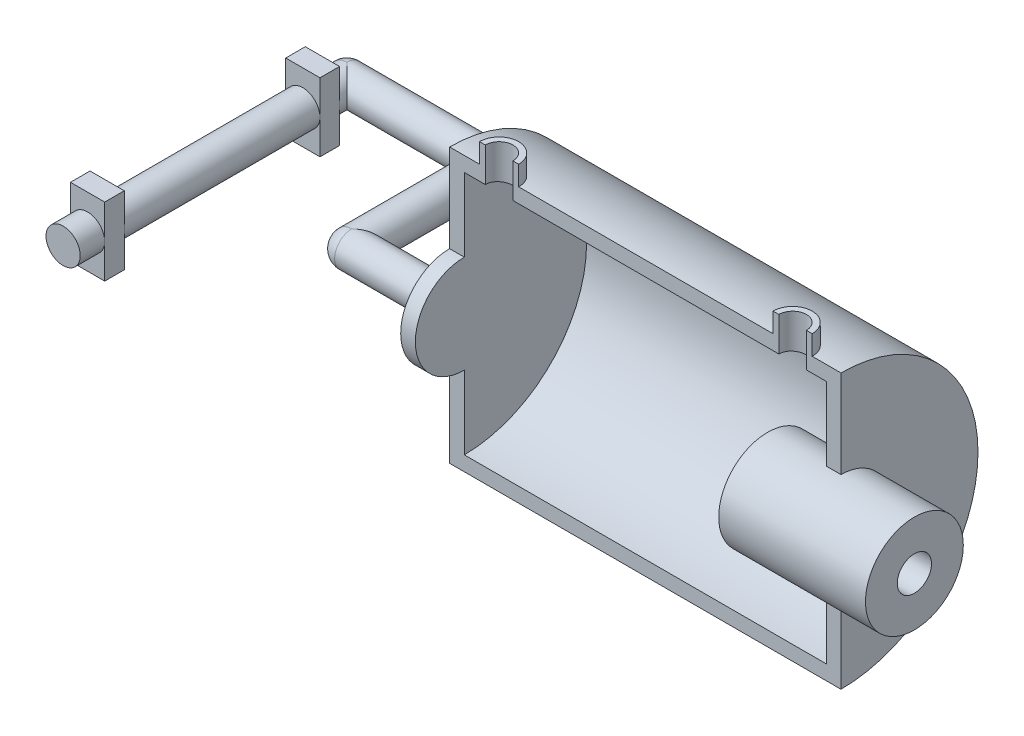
ISO-10303-21;
HEADER;
FILE_DESCRIPTION(('STEP AP214'),'2;1');
FILE_NAME('part.step','',(''),(''),'','','');
FILE_SCHEMA(('AUTOMOTIVE_DESIGN { 1 0 10303 214 1 1 1 1 }'));
ENDSEC;
DATA;
#1=APPLICATION_CONTEXT('core data for automotive mechanical design processes');
#2=APPLICATION_PROTOCOL_DEFINITION('international standard','automotive_design',2000,#1);
#3=PRODUCT_CONTEXT('',#1,'mechanical');
#4=PRODUCT('Part','Part','',(#3));
#5=PRODUCT_RELATED_PRODUCT_CATEGORY('part','',(#4));
#6=PRODUCT_DEFINITION_FORMATION('','',#4);
#7=PRODUCT_DEFINITION_CONTEXT('part definition',#1,'design');
#8=PRODUCT_DEFINITION('design','',#6,#7);
#9=PRODUCT_DEFINITION_SHAPE('','',#8);
#10=(LENGTH_UNIT() NAMED_UNIT(*) SI_UNIT(.MILLI.,.METRE.));
#11=(NAMED_UNIT(*) PLANE_ANGLE_UNIT() SI_UNIT($,.RADIAN.));
#12=(NAMED_UNIT(*) SI_UNIT($,.STERADIAN.) SOLID_ANGLE_UNIT());
#13=UNCERTAINTY_MEASURE_WITH_UNIT(LENGTH_MEASURE(1.E-05),#10,'distance_accuracy_value','');
#14=(GEOMETRIC_REPRESENTATION_CONTEXT(3) GLOBAL_UNCERTAINTY_ASSIGNED_CONTEXT((#13)) GLOBAL_UNIT_ASSIGNED_CONTEXT((#10,
#11,#12)) REPRESENTATION_CONTEXT('',''));
#15=CARTESIAN_POINT('',(0.,0.,0.));
#16=DIRECTION('',(0.,0.,1.));
#17=DIRECTION('',(1.,0.,0.));
#18=AXIS2_PLACEMENT_3D('',#15,#16,#17);
#19=CARTESIAN_POINT('',(39.,28.,0.));
#20=DIRECTION('',(0.,0.,-1.));
#21=DIRECTION('',(-1.,0.,0.));
#22=AXIS2_PLACEMENT_3D('',#19,#20,#21);
#23=PLANE('',#22);
#24=DIRECTION('',(0.,1.,0.));
#25=VECTOR('',#24,1.);
#26=CARTESIAN_POINT('',(62.9248040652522,17.,0.));
#27=LINE('',#26,#25);
#28=CARTESIAN_POINT('',(62.9248040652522,25.,0.));
#29=VERTEX_POINT('',#28);
#30=CARTESIAN_POINT('',(62.9248040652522,32.,0.));
#31=VERTEX_POINT('',#30);
#32=EDGE_CURVE('E366',#29,#31,#27,.T.);
#33=ORIENTED_EDGE('',*,*,#32,.F.);
#34=DIRECTION('',(-1.,0.,0.));
#35=VECTOR('',#34,1.);
#36=CARTESIAN_POINT('',(0.,25.,0.));
#37=LINE('',#36,#35);
#38=CARTESIAN_POINT('',(117.290592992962,25.,0.));
#39=VERTEX_POINT('',#38);
#40=EDGE_CURVE('E367',#39,#29,#37,.T.);
#41=ORIENTED_EDGE('',*,*,#40,.F.);
#42=DIRECTION('',(0.,1.,0.));
#43=VECTOR('',#42,1.);
#44=CARTESIAN_POINT('',(117.290592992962,17.,0.));
#45=LINE('',#44,#43);
#46=CARTESIAN_POINT('',(117.290592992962,32.,0.));
#47=VERTEX_POINT('',#46);
#48=EDGE_CURVE('E246',#39,#47,#45,.T.);
#49=ORIENTED_EDGE('',*,*,#48,.T.);
#50=DIRECTION('',(-1.,0.,0.));
#51=VECTOR('',#50,1.);
#52=CARTESIAN_POINT('',(115.170116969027,32.,0.));
#53=LINE('',#52,#51);
#54=CARTESIAN_POINT('',(116.107698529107,32.,0.));
#55=VERTEX_POINT('',#54);
#56=EDGE_CURVE('E247',#47,#55,#53,.T.);
#57=ORIENTED_EDGE('',*,*,#56,.T.);
#58=DIRECTION('',(0.,1.,0.));
#59=VECTOR('',#58,1.);
#60=CARTESIAN_POINT('',(116.107698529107,35.9053681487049,0.));
#61=LINE('',#60,#59);
#62=CARTESIAN_POINT('',(116.107698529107,28.,0.));
#63=VERTEX_POINT('',#62);
#64=EDGE_CURVE('E266',#55,#63,#61,.F.);
#65=ORIENTED_EDGE('',*,*,#64,.T.);
#66=DIRECTION('',(1.,0.,0.));
#67=VECTOR('',#66,1.);
#68=CARTESIAN_POINT('',(39.,28.,0.));
#69=LINE('',#68,#67);
#70=CARTESIAN_POINT('',(64.1076985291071,28.,0.));
#71=VERTEX_POINT('',#70);
#72=EDGE_CURVE('E411',#71,#63,#69,.T.);
#73=ORIENTED_EDGE('',*,*,#72,.F.);
#74=DIRECTION('',(0.,1.,0.));
#75=VECTOR('',#74,1.);
#76=CARTESIAN_POINT('',(64.1076985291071,35.9053681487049,0.));
#77=LINE('',#76,#75);
#78=CARTESIAN_POINT('',(64.1076985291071,32.,0.));
#79=VERTEX_POINT('',#78);
#80=EDGE_CURVE('E54',#71,#79,#77,.T.);
#81=ORIENTED_EDGE('',*,*,#80,.T.);
#82=DIRECTION('',(-1.,0.,0.));
#83=VECTOR('',#82,1.);
#84=CARTESIAN_POINT('',(56.1076985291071,32.,0.));
#85=LINE('',#84,#83);
#86=EDGE_CURVE('E291',#79,#31,#85,.T.);
#87=ORIENTED_EDGE('',*,*,#86,.T.);
#88=EDGE_LOOP('',(#33,#41,#49,#57,#65,#73,#81,#87));
#89=FACE_BOUND('',#88,.T.);
#90=ADVANCED_FACE('F32',(#89),#23,.F.);
#91=DIRECTION('',(0.,-1.,0.));
#92=VECTOR('',#91,1.);
#93=CARTESIAN_POINT('',(53.,0.,0.));
#94=LINE('',#93,#92);
#95=CARTESIAN_POINT('',(53.,25.,0.));
#96=VERTEX_POINT('',#95);
#97=CARTESIAN_POINT('',(53.,10.,0.));
#98=VERTEX_POINT('',#97);
#99=EDGE_CURVE('E417',#96,#98,#94,.T.);
#100=ORIENTED_EDGE('',*,*,#99,.F.);
#101=CARTESIAN_POINT('',(57.2905929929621,25.,0.));
#102=VERTEX_POINT('',#101);
#103=EDGE_CURVE('E418',#102,#96,#37,.T.);
#104=ORIENTED_EDGE('',*,*,#103,.F.);
#105=DIRECTION('',(0.,1.,0.));
#106=VECTOR('',#105,1.);
#107=CARTESIAN_POINT('',(57.2905929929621,17.,0.));
#108=LINE('',#107,#106);
#109=CARTESIAN_POINT('',(57.2905929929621,32.,0.));
#110=VERTEX_POINT('',#109);
#111=EDGE_CURVE('E372',#102,#110,#108,.T.);
#112=ORIENTED_EDGE('',*,*,#111,.T.);
#113=DIRECTION('',(-1.,0.,0.));
#114=VECTOR('',#113,1.);
#115=CARTESIAN_POINT('',(55.1701169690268,32.,0.));
#116=LINE('',#115,#114);
#117=CARTESIAN_POINT('',(56.1076985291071,32.,0.));
#118=VERTEX_POINT('',#117);
#119=EDGE_CURVE('E373',#110,#118,#116,.T.);
#120=ORIENTED_EDGE('',*,*,#119,.T.);
#121=DIRECTION('',(0.,1.,0.));
#122=VECTOR('',#121,1.);
#123=CARTESIAN_POINT('',(56.1076985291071,35.9053681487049,0.));
#124=LINE('',#123,#122);
#125=CARTESIAN_POINT('',(56.1076985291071,28.,0.));
#126=VERTEX_POINT('',#125);
#127=EDGE_CURVE('E386',#118,#126,#124,.F.);
#128=ORIENTED_EDGE('',*,*,#127,.T.);
#129=CARTESIAN_POINT('',(50.,28.,0.));
#130=VERTEX_POINT('',#129);
#131=EDGE_CURVE('E409',#130,#126,#69,.T.);
#132=ORIENTED_EDGE('',*,*,#131,.F.);
#133=DIRECTION('',(0.,1.,0.));
#134=VECTOR('',#133,1.);
#135=CARTESIAN_POINT('',(50.,0.,0.));
#136=LINE('',#135,#134);
#137=CARTESIAN_POINT('',(50.,10.,0.));
#138=VERTEX_POINT('',#137);
#139=EDGE_CURVE('E423',#138,#130,#136,.T.);
#140=ORIENTED_EDGE('',*,*,#139,.F.);
#141=DIRECTION('',(1.,0.,0.));
#142=VECTOR('',#141,1.);
#143=CARTESIAN_POINT('',(39.,10.,0.));
#144=LINE('',#143,#142);
#145=EDGE_CURVE('E414',#138,#98,#144,.T.);
#146=ORIENTED_EDGE('',*,*,#145,.T.);
#147=EDGE_LOOP('',(#100,#104,#112,#120,#128,#132,#140,#146));
#148=FACE_BOUND('',#147,.T.);
#149=ADVANCED_FACE('F343',(#148),#23,.F.);
#150=CARTESIAN_POINT('',(127.,25.,0.));
#151=DIRECTION('',(1.,0.,0.));
#152=DIRECTION('',(0.,0.,-1.));
#153=AXIS2_PLACEMENT_3D('',#150,#151,#152);
#154=PLANE('',#153);
#155=CARTESIAN_POINT('',(127.,0.,0.));
#156=DIRECTION('',(-1.,0.,0.));
#157=DIRECTION('',(0.,0.,1.));
#158=AXIS2_PLACEMENT_3D('',#155,#156,#157);
#159=CIRCLE('',#158,25.);
#160=CARTESIAN_POINT('',(127.,25.,0.));
#161=VERTEX_POINT('',#160);
#162=CARTESIAN_POINT('',(127.,-25.,0.));
#163=VERTEX_POINT('',#162);
#164=EDGE_CURVE('E458',#161,#163,#159,.T.);
#165=ORIENTED_EDGE('',*,*,#164,.T.);
#166=DIRECTION('',(0.,1.,0.));
#167=VECTOR('',#166,1.);
#168=CARTESIAN_POINT('',(127.,25.,0.));
#169=LINE('',#168,#167);
#170=CARTESIAN_POINT('',(127.,-10.,0.));
#171=VERTEX_POINT('',#170);
#172=EDGE_CURVE('E432',#163,#171,#169,.T.);
#173=ORIENTED_EDGE('',*,*,#172,.T.);
#174=CARTESIAN_POINT('',(127.,0.,0.));
#175=DIRECTION('',(1.,0.,0.));
#176=DIRECTION('',(0.,0.,-1.));
#177=AXIS2_PLACEMENT_3D('',#174,#175,#176);
#178=CIRCLE('',#177,10.);
#179=CARTESIAN_POINT('',(127.,10.,0.));
#180=VERTEX_POINT('',#179);
#181=EDGE_CURVE('E311',#180,#171,#178,.F.);
#182=ORIENTED_EDGE('',*,*,#181,.F.);
#183=DIRECTION('',(0.,1.,0.));
#184=VECTOR('',#183,1.);
#185=CARTESIAN_POINT('',(127.,25.,0.));
#186=LINE('',#185,#184);
#187=EDGE_CURVE('E421',#180,#161,#186,.T.);
#188=ORIENTED_EDGE('',*,*,#187,.T.);
#189=EDGE_LOOP('',(#165,#173,#182,#188));
#190=FACE_BOUND('',#189,.T.);
#191=ADVANCED_FACE('F363',(#190),#154,.F.);
#192=CARTESIAN_POINT('',(53.,0.,0.));
#193=DIRECTION('',(-1.,0.,0.));
#194=DIRECTION('',(0.,0.,1.));
#195=AXIS2_PLACEMENT_3D('',#192,#193,#194);
#196=PLANE('',#195);
#197=CARTESIAN_POINT('',(53.,0.,0.));
#198=DIRECTION('',(-1.,0.,0.));
#199=DIRECTION('',(0.,0.,1.));
#200=AXIS2_PLACEMENT_3D('',#197,#198,#199);
#201=CIRCLE('',#200,10.);
#202=CARTESIAN_POINT('',(53.,-10.,0.));
#203=VERTEX_POINT('',#202);
#204=EDGE_CURVE('E438',#98,#203,#201,.F.);
#205=ORIENTED_EDGE('',*,*,#204,.T.);
#206=DIRECTION('',(0.,-1.,0.));
#207=VECTOR('',#206,1.);
#208=CARTESIAN_POINT('',(53.,0.,0.));
#209=LINE('',#208,#207);
#210=CARTESIAN_POINT('',(53.,-25.,0.));
#211=VERTEX_POINT('',#210);
#212=EDGE_CURVE('E429',#203,#211,#209,.T.);
#213=ORIENTED_EDGE('',*,*,#212,.T.);
#214=CARTESIAN_POINT('',(53.,0.,0.));
#215=DIRECTION('',(-1.,0.,0.));
#216=DIRECTION('',(0.,0.,1.));
#217=AXIS2_PLACEMENT_3D('',#214,#215,#216);
#218=CIRCLE('',#217,25.);
#219=EDGE_CURVE('E461',#96,#211,#218,.T.);
#220=ORIENTED_EDGE('',*,*,#219,.F.);
#221=ORIENTED_EDGE('',*,*,#99,.T.);
#222=EDGE_LOOP('',(#205,#213,#220,#221));
#223=FACE_BOUND('',#222,.T.);
#224=ADVANCED_FACE('F750',(#223),#196,.F.);
#225=CARTESIAN_POINT('',(0.,0.,0.));
#226=DIRECTION('',(-1.,0.,0.));
#227=DIRECTION('',(0.,0.,1.));
#228=AXIS2_PLACEMENT_3D('',#225,#226,#227);
#229=CYLINDRICAL_SURFACE('',#228,25.);
#230=CARTESIAN_POINT('',(122.924804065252,25.,0.));
#231=VERTEX_POINT('',#230);
#232=EDGE_CURVE('E415',#161,#231,#37,.T.);
#233=ORIENTED_EDGE('',*,*,#232,.T.);
#234=CARTESIAN_POINT('',(122.924804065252,25.,0.));
#235=CARTESIAN_POINT('',(122.924811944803,25.0000036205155,-0.0789677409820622));
#236=CARTESIAN_POINT('',(122.921483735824,24.9996259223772,-0.15793154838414));
#237=CARTESIAN_POINT('',(122.908216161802,24.9981346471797,-0.315289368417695));
#238=CARTESIAN_POINT('',(122.898277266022,24.9970211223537,-0.393683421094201));
#239=CARTESIAN_POINT('',(122.871862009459,24.994086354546,-0.549276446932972));
#240=CARTESIAN_POINT('',(122.855391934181,24.9922657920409,-0.626476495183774));
#241=CARTESIAN_POINT('',(122.816051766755,24.9879714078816,-0.77918684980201));
#242=CARTESIAN_POINT('',(122.79318172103,24.9854975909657,-0.854697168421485));
#243=CARTESIAN_POINT('',(122.715170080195,24.9771917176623,-1.07794859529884));
#244=CARTESIAN_POINT('',(122.650612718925,24.9704735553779,-1.22249367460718));
#245=CARTESIAN_POINT('',(122.498339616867,24.9554278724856,-1.49860292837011));
#246=CARTESIAN_POINT('',(122.410626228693,24.9471005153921,-1.63016841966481));
#247=CARTESIAN_POINT('',(122.214092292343,24.9297255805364,-1.87728349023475));
#248=CARTESIAN_POINT('',(122.105190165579,24.9206753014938,-1.99276810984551));
#249=CARTESIAN_POINT('',(121.869537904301,24.9028957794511,-2.20386920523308));
#250=CARTESIAN_POINT('',(121.742785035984,24.8941665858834,-2.29948263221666));
#251=CARTESIAN_POINT('',(121.474614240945,24.877991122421,-2.46835935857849));
#252=CARTESIAN_POINT('',(121.333157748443,24.8705483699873,-2.54156178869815));
#253=CARTESIAN_POINT('',(121.039870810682,24.8578242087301,-2.66314384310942));
#254=CARTESIAN_POINT('',(120.888041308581,24.8525426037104,-2.71152572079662));
#255=CARTESIAN_POINT('',(120.578993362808,24.8447637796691,-2.7819010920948));
#256=CARTESIAN_POINT('',(120.421800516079,24.8422548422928,-2.80400567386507));
#257=CARTESIAN_POINT('',(120.105913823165,24.8402693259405,-2.82154250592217));
#258=CARTESIAN_POINT('',(119.947219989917,24.8407927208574,-2.81697498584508));
#259=CARTESIAN_POINT('',(119.633614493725,24.844802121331,-2.78138774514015));
#260=CARTESIAN_POINT('',(119.478688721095,24.8482743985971,-2.75049059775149));
#261=CARTESIAN_POINT('',(119.176236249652,24.8577688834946,-2.66331224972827));
#262=CARTESIAN_POINT('',(119.02870963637,24.8637911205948,-2.60703075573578));
#263=CARTESIAN_POINT('',(118.74485553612,24.8777228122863,-2.47054657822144));
#264=CARTESIAN_POINT('',(118.608554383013,24.8856365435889,-2.39028958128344));
#265=CARTESIAN_POINT('',(118.351315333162,24.9024556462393,-2.20817495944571));
#266=CARTESIAN_POINT('',(118.230377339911,24.9113610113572,-2.10631747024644));
#267=CARTESIAN_POINT('',(118.006594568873,24.9292201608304,-1.88322742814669));
#268=CARTESIAN_POINT('',(117.903852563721,24.9381739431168,-1.76189176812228));
#269=CARTESIAN_POINT('',(117.720147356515,24.9550780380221,-1.50359544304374));
#270=CARTESIAN_POINT('',(117.639190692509,24.9630280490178,-1.36663010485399));
#271=CARTESIAN_POINT('',(117.501358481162,24.9770334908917,-1.08086931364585));
#272=CARTESIAN_POINT('',(117.444503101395,24.9830873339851,-0.932064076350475));
#273=CARTESIAN_POINT('',(117.35669842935,24.9925985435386,-0.627045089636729));
#274=CARTESIAN_POINT('',(117.325710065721,24.9960598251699,-0.470842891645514));
#275=CARTESIAN_POINT('',(117.302243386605,24.9986896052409,-0.26127717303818));
#276=CARTESIAN_POINT('',(117.297872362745,24.999180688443,-0.20907224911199));
#277=CARTESIAN_POINT('',(117.292051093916,24.9998354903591,-0.104585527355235));
#278=CARTESIAN_POINT('',(117.290595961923,24.9999997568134,-0.0523040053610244));
#279=CARTESIAN_POINT('',(117.290592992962,25.,0.));
#280=B_SPLINE_CURVE_WITH_KNOTS('',3,(#234,#235,#236,#237,#238,#239,#240,#241,#242,#243,#244,
#245,#246,#247,#248,#249,#250,#251,#252,#253,#254,#255,#256,#257,#258,#259,#260,#261,#262,#263,
#264,#265,#266,#267,#268,#269,#270,#271,#272,#273,#274,#275,#276,#277,#278,#279),.UNSPECIFIED.,
.F.,.F.,(4,2,2,2,2,2,2,2,2,2,2,2,2,2,2,2,2,2,2,2,2,2,4),(0.,0.236825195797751,0.473633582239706,
0.710214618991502,0.946793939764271,1.41970160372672,1.89256123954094,2.36727880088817,
2.84206914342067,3.31813782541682,3.79416327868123,4.26816907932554,4.74217079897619,
5.21397786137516,5.68579037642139,6.15867993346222,6.63156651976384,7.10704428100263,
7.58266458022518,8.05868208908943,8.53397928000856,8.69108940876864,8.84793600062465),.UNSPECIFIED.);
#281=EDGE_CURVE('E244',#231,#39,#280,.T.);
#282=ORIENTED_EDGE('',*,*,#281,.T.);
#283=ORIENTED_EDGE('',*,*,#40,.T.);
#284=CARTESIAN_POINT('',(62.9248040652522,25.,0.));
#285=CARTESIAN_POINT('',(62.9248119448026,25.0000036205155,-0.0789677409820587));
#286=CARTESIAN_POINT('',(62.9214837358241,24.9996259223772,-0.157931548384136));
#287=CARTESIAN_POINT('',(62.9082161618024,24.9981346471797,-0.315289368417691));
#288=CARTESIAN_POINT('',(62.898277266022,24.9970211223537,-0.393683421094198));
#289=CARTESIAN_POINT('',(62.8718620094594,24.994086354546,-0.549276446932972));
#290=CARTESIAN_POINT('',(62.8553919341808,24.9922657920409,-0.626476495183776));
#291=CARTESIAN_POINT('',(62.816051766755,24.9879714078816,-0.779186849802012));
#292=CARTESIAN_POINT('',(62.7931817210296,24.9854975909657,-0.854697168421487));
#293=CARTESIAN_POINT('',(62.7151700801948,24.9771917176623,-1.07794859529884));
#294=CARTESIAN_POINT('',(62.6506127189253,24.9704735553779,-1.22249367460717));
#295=CARTESIAN_POINT('',(62.4983396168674,24.9554278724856,-1.49860292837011));
#296=CARTESIAN_POINT('',(62.4106262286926,24.9471005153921,-1.63016841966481));
#297=CARTESIAN_POINT('',(62.2140922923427,24.9297255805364,-1.87728349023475));
#298=CARTESIAN_POINT('',(62.1051901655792,24.9206753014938,-1.99276810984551));
#299=CARTESIAN_POINT('',(61.8695379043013,24.9028957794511,-2.20386920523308));
#300=CARTESIAN_POINT('',(61.7427850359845,24.8941665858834,-2.29948263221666));
#301=CARTESIAN_POINT('',(61.4746142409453,24.877991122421,-2.46835935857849));
#302=CARTESIAN_POINT('',(61.3331577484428,24.8705483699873,-2.54156178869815));
#303=CARTESIAN_POINT('',(61.0398708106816,24.8578242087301,-2.66314384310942));
#304=CARTESIAN_POINT('',(60.8880413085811,24.8525426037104,-2.71152572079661));
#305=CARTESIAN_POINT('',(60.5789933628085,24.8447637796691,-2.7819010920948));
#306=CARTESIAN_POINT('',(60.4218005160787,24.8422548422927,-2.80400567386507));
#307=CARTESIAN_POINT('',(60.1059138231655,24.8402693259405,-2.82154250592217));
#308=CARTESIAN_POINT('',(59.9472199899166,24.8407927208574,-2.81697498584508));
#309=CARTESIAN_POINT('',(59.6336144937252,24.844802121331,-2.78138774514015));
#310=CARTESIAN_POINT('',(59.478688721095,24.8482743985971,-2.75049059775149));
#311=CARTESIAN_POINT('',(59.1762362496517,24.8577688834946,-2.66331224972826));
#312=CARTESIAN_POINT('',(59.0287096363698,24.8637911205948,-2.60703075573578));
#313=CARTESIAN_POINT('',(58.7448555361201,24.8777228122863,-2.47054657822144));
#314=CARTESIAN_POINT('',(58.6085543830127,24.8856365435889,-2.39028958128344));
#315=CARTESIAN_POINT('',(58.3513153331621,24.9024556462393,-2.20817495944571));
#316=CARTESIAN_POINT('',(58.2303773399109,24.9113610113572,-2.10631747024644));
#317=CARTESIAN_POINT('',(58.0065945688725,24.9292201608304,-1.8832274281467));
#318=CARTESIAN_POINT('',(57.9038525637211,24.9381739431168,-1.76189176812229));
#319=CARTESIAN_POINT('',(57.7201473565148,24.9550780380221,-1.50359544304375));
#320=CARTESIAN_POINT('',(57.6391906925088,24.9630280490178,-1.36663010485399));
#321=CARTESIAN_POINT('',(57.5013584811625,24.9770334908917,-1.08086931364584));
#322=CARTESIAN_POINT('',(57.4445031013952,24.9830873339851,-0.932064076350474));
#323=CARTESIAN_POINT('',(57.3566984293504,24.9925985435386,-0.627045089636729));
#324=CARTESIAN_POINT('',(57.3257100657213,24.9960598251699,-0.470842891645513));
#325=CARTESIAN_POINT('',(57.3022433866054,24.9986896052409,-0.261277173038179));
#326=CARTESIAN_POINT('',(57.2978723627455,24.999180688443,-0.20907224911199));
#327=CARTESIAN_POINT('',(57.2920510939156,24.9998354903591,-0.104585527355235));
#328=CARTESIAN_POINT('',(57.2905959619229,24.9999997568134,-0.0523040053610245));
#329=CARTESIAN_POINT('',(57.2905929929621,25.,0.));
#330=B_SPLINE_CURVE_WITH_KNOTS('',3,(#284,#285,#286,#287,#288,#289,#290,#291,#292,#293,#294,
#295,#296,#297,#298,#299,#300,#301,#302,#303,#304,#305,#306,#307,#308,#309,#310,#311,#312,#313,
#314,#315,#316,#317,#318,#319,#320,#321,#322,#323,#324,#325,#326,#327,#328,#329),.UNSPECIFIED.,
.F.,.F.,(4,2,2,2,2,2,2,2,2,2,2,2,2,2,2,2,2,2,2,2,2,2,4),(0.,0.23682519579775,0.473633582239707,
0.710214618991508,0.946793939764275,1.41970160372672,1.89256123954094,2.36727880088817,
2.84206914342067,3.31813782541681,3.79416327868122,4.26816907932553,4.74217079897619,
5.21397786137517,5.68579037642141,6.15867993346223,6.63156651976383,7.10704428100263,
7.58266458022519,8.05868208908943,8.53397928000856,8.69108940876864,8.84793600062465),.UNSPECIFIED.);
#331=EDGE_CURVE('E380',#29,#102,#330,.T.);
#332=ORIENTED_EDGE('',*,*,#331,.T.);
#333=ORIENTED_EDGE('',*,*,#103,.T.);
#334=ORIENTED_EDGE('',*,*,#219,.T.);
#335=DIRECTION('',(-1.,0.,0.));
#336=VECTOR('',#335,1.);
#337=CARTESIAN_POINT('',(0.,-25.,0.));
#338=LINE('',#337,#336);
#339=EDGE_CURVE('E426',#211,#163,#338,.F.);
#340=ORIENTED_EDGE('',*,*,#339,.T.);
#341=ORIENTED_EDGE('',*,*,#164,.F.);
#342=EDGE_LOOP('',(#233,#282,#283,#332,#333,#334,#340,#341));
#343=FACE_BOUND('',#342,.T.);
#344=ADVANCED_FACE('F268',(#343),#229,.F.);
#345=CARTESIAN_POINT('',(115.,0.,0.));
#346=DIRECTION('',(1.,0.,0.));
#347=DIRECTION('',(0.,0.,-1.));
#348=AXIS2_PLACEMENT_3D('',#345,#346,#347);
#349=PLANE('',#348);
#350=CARTESIAN_POINT('',(115.,0.,0.));
#351=DIRECTION('',(1.,0.,0.));
#352=DIRECTION('',(0.,0.,-1.));
#353=AXIS2_PLACEMENT_3D('',#350,#351,#352);
#354=CIRCLE('',#353,3.5);
#355=CARTESIAN_POINT('',(115.,0.,-3.5));
#356=VERTEX_POINT('',#355);
#357=EDGE_CURVE('E395',#356,#356,#354,.T.);
#358=ORIENTED_EDGE('',*,*,#357,.T.);
#359=EDGE_LOOP('',(#358));
#360=FACE_BOUND('',#359,.T.);
#361=CARTESIAN_POINT('',(115.,0.,0.));
#362=DIRECTION('',(1.,0.,0.));
#363=DIRECTION('',(0.,0.,-1.));
#364=AXIS2_PLACEMENT_3D('',#361,#362,#363);
#365=CIRCLE('',#364,10.);
#366=CARTESIAN_POINT('',(115.,0.,-10.));
#367=VERTEX_POINT('',#366);
#368=EDGE_CURVE('E444',#367,#367,#365,.T.);
#369=ORIENTED_EDGE('',*,*,#368,.F.);
#370=EDGE_LOOP('',(#369));
#371=FACE_BOUND('',#370,.T.);
#372=ADVANCED_FACE('F346',(#360,#371),#349,.F.);
#373=CARTESIAN_POINT('',(39.,0.,0.));
#374=DIRECTION('',(1.,0.,0.));
#375=DIRECTION('',(0.,0.,-1.));
#376=AXIS2_PLACEMENT_3D('',#373,#374,#375);
#377=CYLINDRICAL_SURFACE('',#376,10.);
#378=DIRECTION('',(1.,0.,0.));
#379=VECTOR('',#378,1.);
#380=CARTESIAN_POINT('',(39.,-10.,0.));
#381=LINE('',#380,#379);
#382=CARTESIAN_POINT('',(50.,-10.,0.));
#383=VERTEX_POINT('',#382);
#384=EDGE_CURVE('E406',#383,#203,#381,.T.);
#385=ORIENTED_EDGE('',*,*,#384,.T.);
#386=ORIENTED_EDGE('',*,*,#204,.F.);
#387=ORIENTED_EDGE('',*,*,#145,.F.);
#388=CARTESIAN_POINT('',(50.,0.,0.));
#389=DIRECTION('',(1.,0.,0.));
#390=DIRECTION('',(0.,0.,-1.));
#391=AXIS2_PLACEMENT_3D('',#388,#389,#390);
#392=CIRCLE('',#391,10.);
#393=EDGE_CURVE('E441',#383,#138,#392,.F.);
#394=ORIENTED_EDGE('',*,*,#393,.F.);
#395=EDGE_LOOP('',(#385,#386,#387,#394));
#396=FACE_BOUND('',#395,.T.);
#397=ADVANCED_FACE('F339',(#396),#377,.T.);
#398=CARTESIAN_POINT('',(39.,-10.,0.));
#399=DIRECTION('',(0.,0.,-1.));
#400=DIRECTION('',(-1.,0.,0.));
#401=AXIS2_PLACEMENT_3D('',#398,#399,#400);
#402=PLANE('',#401);
#403=DIRECTION('',(1.,0.,0.));
#404=VECTOR('',#403,1.);
#405=CARTESIAN_POINT('',(39.,-28.,0.));
#406=LINE('',#405,#404);
#407=CARTESIAN_POINT('',(50.,-28.,0.));
#408=VERTEX_POINT('',#407);
#409=CARTESIAN_POINT('',(130.,-28.,0.));
#410=VERTEX_POINT('',#409);
#411=EDGE_CURVE('E407',#408,#410,#406,.T.);
#412=ORIENTED_EDGE('',*,*,#411,.T.);
#413=DIRECTION('',(0.,1.,0.));
#414=VECTOR('',#413,1.);
#415=CARTESIAN_POINT('',(130.,-10.,0.));
#416=LINE('',#415,#414);
#417=CARTESIAN_POINT('',(130.,-10.,0.));
#418=VERTEX_POINT('',#417);
#419=EDGE_CURVE('E400',#410,#418,#416,.T.);
#420=ORIENTED_EDGE('',*,*,#419,.T.);
#421=EDGE_CURVE('E403',#171,#418,#381,.T.);
#422=ORIENTED_EDGE('',*,*,#421,.F.);
#423=ORIENTED_EDGE('',*,*,#172,.F.);
#424=ORIENTED_EDGE('',*,*,#339,.F.);
#425=ORIENTED_EDGE('',*,*,#212,.F.);
#426=ORIENTED_EDGE('',*,*,#384,.F.);
#427=DIRECTION('',(0.,1.,0.));
#428=VECTOR('',#427,1.);
#429=CARTESIAN_POINT('',(50.,0.,0.));
#430=LINE('',#429,#428);
#431=EDGE_CURVE('E435',#408,#383,#430,.T.);
#432=ORIENTED_EDGE('',*,*,#431,.F.);
#433=EDGE_LOOP('',(#412,#420,#422,#423,#424,#425,#426,#432));
#434=FACE_BOUND('',#433,.T.);
#435=ADVANCED_FACE('F336',(#434),#402,.F.);
#436=DIRECTION('',(0.,1.,0.));
#437=VECTOR('',#436,1.);
#438=CARTESIAN_POINT('',(130.,28.,0.));
#439=LINE('',#438,#437);
#440=CARTESIAN_POINT('',(130.,10.,0.));
#441=VERTEX_POINT('',#440);
#442=CARTESIAN_POINT('',(130.,28.,0.));
#443=VERTEX_POINT('',#442);
#444=EDGE_CURVE('E398',#441,#443,#439,.T.);
#445=ORIENTED_EDGE('',*,*,#444,.T.);
#446=CARTESIAN_POINT('',(124.107698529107,28.,0.));
#447=VERTEX_POINT('',#446);
#448=EDGE_CURVE('E412',#447,#443,#69,.T.);
#449=ORIENTED_EDGE('',*,*,#448,.F.);
#450=DIRECTION('',(0.,1.,0.));
#451=VECTOR('',#450,1.);
#452=CARTESIAN_POINT('',(124.107698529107,35.9053681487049,0.));
#453=LINE('',#452,#451);
#454=CARTESIAN_POINT('',(124.107698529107,32.,0.));
#455=VERTEX_POINT('',#454);
#456=EDGE_CURVE('E46',#447,#455,#453,.T.);
#457=ORIENTED_EDGE('',*,*,#456,.T.);
#458=DIRECTION('',(-1.,0.,0.));
#459=VECTOR('',#458,1.);
#460=CARTESIAN_POINT('',(116.107698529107,32.,0.));
#461=LINE('',#460,#459);
#462=CARTESIAN_POINT('',(122.924804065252,32.,0.));
#463=VERTEX_POINT('',#462);
#464=EDGE_CURVE('E11',#455,#463,#461,.T.);
#465=ORIENTED_EDGE('',*,*,#464,.T.);
#466=DIRECTION('',(0.,1.,0.));
#467=VECTOR('',#466,1.);
#468=CARTESIAN_POINT('',(122.924804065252,17.,0.));
#469=LINE('',#468,#467);
#470=EDGE_CURVE('E237',#231,#463,#469,.T.);
#471=ORIENTED_EDGE('',*,*,#470,.F.);
#472=ORIENTED_EDGE('',*,*,#232,.F.);
#473=ORIENTED_EDGE('',*,*,#187,.F.);
#474=EDGE_CURVE('E402',#180,#441,#144,.T.);
#475=ORIENTED_EDGE('',*,*,#474,.T.);
#476=EDGE_LOOP('',(#445,#449,#457,#465,#471,#472,#473,#475));
#477=FACE_BOUND('',#476,.T.);
#478=ADVANCED_FACE('F250',(#477),#23,.F.);
#479=CARTESIAN_POINT('',(130.,28.,0.));
#480=DIRECTION('',(-1.,0.,0.));
#481=DIRECTION('',(0.,0.,1.));
#482=AXIS2_PLACEMENT_3D('',#479,#480,#481);
#483=PLANE('',#482);
#484=CARTESIAN_POINT('',(130.,0.,0.));
#485=DIRECTION('',(-1.,0.,0.));
#486=DIRECTION('',(0.,0.,1.));
#487=AXIS2_PLACEMENT_3D('',#484,#485,#486);
#488=CIRCLE('',#487,10.);
#489=EDGE_CURVE('E310',#418,#441,#488,.F.);
#490=ORIENTED_EDGE('',*,*,#489,.F.);
#491=ORIENTED_EDGE('',*,*,#419,.F.);
#492=CARTESIAN_POINT('',(130.,0.,0.));
#493=DIRECTION('',(-1.,0.,0.));
#494=DIRECTION('',(0.,0.,1.));
#495=AXIS2_PLACEMENT_3D('',#492,#493,#494);
#496=CIRCLE('',#495,28.);
#497=EDGE_CURVE('E455',#443,#410,#496,.T.);
#498=ORIENTED_EDGE('',*,*,#497,.F.);
#499=ORIENTED_EDGE('',*,*,#444,.F.);
#500=EDGE_LOOP('',(#490,#491,#498,#499));
#501=FACE_BOUND('',#500,.T.);
#502=ADVANCED_FACE('F302',(#501),#483,.F.);
#503=CARTESIAN_POINT('',(30.,0.,-29.));
#504=DIRECTION('',(0.,0.,-1.));
#505=DIRECTION('',(-1.,0.,0.));
#506=AXIS2_PLACEMENT_3D('',#503,#504,#505);
#507=CYLINDRICAL_SURFACE('',#506,3.5);
#508=CARTESIAN_POINT('',(30.,0.,-29.));
#509=DIRECTION('',(0.,0.,-1.));
#510=DIRECTION('',(-1.,0.,0.));
#511=AXIS2_PLACEMENT_3D('',#508,#509,#510);
#512=CIRCLE('',#511,3.5);
#513=CARTESIAN_POINT('',(30.,3.5,-29.));
#514=VERTEX_POINT('',#513);
#515=CARTESIAN_POINT('',(30.,-3.5,-29.));
#516=VERTEX_POINT('',#515);
#517=EDGE_CURVE('E472',#514,#516,#512,.T.);
#518=ORIENTED_EDGE('',*,*,#517,.F.);
#519=CARTESIAN_POINT('',(30.,0.,-29.));
#520=DIRECTION('',(-0.707106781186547,0.,-0.707106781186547));
#521=DIRECTION('',(-0.707106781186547,0.,0.707106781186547));
#522=AXIS2_PLACEMENT_3D('',#519,#520,#521);
#523=ELLIPSE('',#522,4.94974746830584,3.5);
#524=EDGE_CURVE('E478',#514,#516,#523,.F.);
#525=ORIENTED_EDGE('',*,*,#524,.T.);
#526=EDGE_LOOP('',(#518,#525));
#527=FACE_BOUND('',#526,.T.);
#528=CARTESIAN_POINT('',(30.,0.,0.));
#529=DIRECTION('',(-0.707106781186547,0.,-0.707106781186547));
#530=DIRECTION('',(0.707106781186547,0.,-0.707106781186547));
#531=AXIS2_PLACEMENT_3D('',#528,#529,#530);
#532=ELLIPSE('',#531,4.94974746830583,3.5);
#533=CARTESIAN_POINT('',(30.,-3.5,0.));
#534=VERTEX_POINT('',#533);
#535=CARTESIAN_POINT('',(30.,3.5,0.));
#536=VERTEX_POINT('',#535);
#537=EDGE_CURVE('E470',#534,#536,#532,.F.);
#538=ORIENTED_EDGE('',*,*,#537,.F.);
#539=CARTESIAN_POINT('',(30.,0.,0.));
#540=DIRECTION('',(0.,0.,-1.));
#541=DIRECTION('',(-1.,0.,0.));
#542=AXIS2_PLACEMENT_3D('',#539,#540,#541);
#543=CIRCLE('',#542,3.5);
#544=EDGE_CURVE('E475',#534,#536,#543,.T.);
#545=ORIENTED_EDGE('',*,*,#544,.T.);
#546=EDGE_LOOP('',(#538,#545));
#547=FACE_BOUND('',#546,.T.);
#548=ADVANCED_FACE('F671',(#527,#547),#507,.T.);
#549=CARTESIAN_POINT('',(30.,0.,-29.));
#550=DIRECTION('',(-1.,0.,0.));
#551=DIRECTION('',(0.,0.,1.));
#552=AXIS2_PLACEMENT_3D('',#549,#550,#551);
#553=CYLINDRICAL_SURFACE('',#552,3.5);
#554=CARTESIAN_POINT('',(0.,0.,-29.));
#555=DIRECTION('',(1.,0.,0.));
#556=DIRECTION('',(0.,0.,-1.));
#557=AXIS2_PLACEMENT_3D('',#554,#555,#556);
#558=CIRCLE('',#557,3.5);
#559=CARTESIAN_POINT('',(0.,-3.5,-29.));
#560=VERTEX_POINT('',#559);
#561=CARTESIAN_POINT('',(0.,3.5,-29.));
#562=VERTEX_POINT('',#561);
#563=EDGE_CURVE('E481',#560,#562,#558,.T.);
#564=ORIENTED_EDGE('',*,*,#563,.T.);
#565=CARTESIAN_POINT('',(0.,0.,-29.));
#566=DIRECTION('',(-0.707106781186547,0.,0.707106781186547));
#567=DIRECTION('',(0.707106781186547,0.,0.707106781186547));
#568=AXIS2_PLACEMENT_3D('',#565,#566,#567);
#569=ELLIPSE('',#568,4.94974746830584,3.5);
#570=EDGE_CURVE('E487',#562,#560,#569,.F.);
#571=ORIENTED_EDGE('',*,*,#570,.T.);
#572=EDGE_LOOP('',(#564,#571));
#573=FACE_BOUND('',#572,.T.);
#574=ORIENTED_EDGE('',*,*,#524,.F.);
#575=CARTESIAN_POINT('',(30.,0.,-29.));
#576=DIRECTION('',(1.,0.,0.));
#577=DIRECTION('',(0.,0.,-1.));
#578=AXIS2_PLACEMENT_3D('',#575,#576,#577);
#579=CIRCLE('',#578,3.5);
#580=EDGE_CURVE('E484',#516,#514,#579,.T.);
#581=ORIENTED_EDGE('',*,*,#580,.F.);
#582=EDGE_LOOP('',(#574,#581));
#583=FACE_BOUND('',#582,.T.);
#584=ADVANCED_FACE('F667',(#573,#583),#553,.T.);
#585=CARTESIAN_POINT('',(0.,0.,-29.));
#586=DIRECTION('',(0.,0.,1.));
#587=DIRECTION('',(1.,0.,0.));
#588=AXIS2_PLACEMENT_3D('',#585,#586,#587);
#589=CYLINDRICAL_SURFACE('',#588,3.5);
#590=CARTESIAN_POINT('',(0.,0.,-24.));
#591=DIRECTION('',(0.,0.,-1.));
#592=DIRECTION('',(-1.,0.,0.));
#593=AXIS2_PLACEMENT_3D('',#590,#591,#592);
#594=CIRCLE('',#593,3.5);
#595=CARTESIAN_POINT('',(-3.5,0.,-24.));
#596=VERTEX_POINT('',#595);
#597=CARTESIAN_POINT('',(3.5,0.,-24.));
#598=VERTEX_POINT('',#597);
#599=EDGE_CURVE('E539',#596,#598,#594,.T.);
#600=ORIENTED_EDGE('',*,*,#599,.T.);
#601=EDGE_CURVE('E543',#598,#596,#594,.T.);
#602=ORIENTED_EDGE('',*,*,#601,.T.);
#603=EDGE_LOOP('',(#600,#602));
#604=FACE_BOUND('',#603,.T.);
#605=ORIENTED_EDGE('',*,*,#570,.F.);
#606=CARTESIAN_POINT('',(0.,0.,-29.));
#607=DIRECTION('',(0.,0.,-1.));
#608=DIRECTION('',(-1.,0.,0.));
#609=AXIS2_PLACEMENT_3D('',#606,#607,#608);
#610=CIRCLE('',#609,3.5);
#611=EDGE_CURVE('E542',#560,#562,#610,.T.);
#612=ORIENTED_EDGE('',*,*,#611,.F.);
#613=EDGE_LOOP('',(#605,#612));
#614=FACE_BOUND('',#613,.T.);
#615=ADVANCED_FACE('F618',(#604,#614),#589,.T.);
#616=CARTESIAN_POINT('',(3.5,-7.,24.));
#617=DIRECTION('',(0.,0.,1.));
#618=DIRECTION('',(-1.,0.,0.));
#619=AXIS2_PLACEMENT_3D('',#616,#617,#618);
#620=PLANE('',#619);
#621=DIRECTION('',(0.,1.,0.));
#622=VECTOR('',#621,1.);
#623=CARTESIAN_POINT('',(-3.5,7.,24.));
#624=LINE('',#623,#622);
#625=CARTESIAN_POINT('',(-3.5,0.,24.));
#626=VERTEX_POINT('',#625);
#627=CARTESIAN_POINT('',(-3.5,7.,24.));
#628=VERTEX_POINT('',#627);
#629=EDGE_CURVE('E518',#626,#628,#624,.T.);
#630=ORIENTED_EDGE('',*,*,#629,.F.);
#631=CARTESIAN_POINT('',(0.,0.,24.));
#632=DIRECTION('',(0.,0.,-1.));
#633=DIRECTION('',(-1.,0.,0.));
#634=AXIS2_PLACEMENT_3D('',#631,#632,#633);
#635=CIRCLE('',#634,3.5);
#636=CARTESIAN_POINT('',(3.5,0.,24.));
#637=VERTEX_POINT('',#636);
#638=EDGE_CURVE('E490',#626,#637,#635,.T.);
#639=ORIENTED_EDGE('',*,*,#638,.T.);
#640=DIRECTION('',(0.,-1.,0.));
#641=VECTOR('',#640,1.);
#642=CARTESIAN_POINT('',(3.5,7.,24.));
#643=LINE('',#642,#641);
#644=CARTESIAN_POINT('',(3.5,7.,24.));
#645=VERTEX_POINT('',#644);
#646=EDGE_CURVE('E512',#645,#637,#643,.T.);
#647=ORIENTED_EDGE('',*,*,#646,.F.);
#648=DIRECTION('',(1.,0.,0.));
#649=VECTOR('',#648,1.);
#650=CARTESIAN_POINT('',(3.5,7.,24.));
#651=LINE('',#650,#649);
#652=EDGE_CURVE('E515',#628,#645,#651,.T.);
#653=ORIENTED_EDGE('',*,*,#652,.F.);
#654=EDGE_LOOP('',(#630,#639,#647,#653));
#655=FACE_BOUND('',#654,.T.);
#656=ADVANCED_FACE('F637',(#655),#620,.T.);
#657=CARTESIAN_POINT('',(3.5,-7.,24.));
#658=VERTEX_POINT('',#657);
#659=EDGE_CURVE('E511',#637,#658,#643,.T.);
#660=ORIENTED_EDGE('',*,*,#659,.F.);
#661=EDGE_CURVE('E494',#637,#626,#635,.T.);
#662=ORIENTED_EDGE('',*,*,#661,.T.);
#663=CARTESIAN_POINT('',(-3.5,-7.,24.));
#664=VERTEX_POINT('',#663);
#665=EDGE_CURVE('E519',#664,#626,#624,.T.);
#666=ORIENTED_EDGE('',*,*,#665,.F.);
#667=DIRECTION('',(-1.,0.,0.));
#668=VECTOR('',#667,1.);
#669=CARTESIAN_POINT('',(3.5,-7.,24.));
#670=LINE('',#669,#668);
#671=EDGE_CURVE('E522',#658,#664,#670,.T.);
#672=ORIENTED_EDGE('',*,*,#671,.F.);
#673=EDGE_LOOP('',(#660,#662,#666,#672));
#674=FACE_BOUND('',#673,.T.);
#675=ADVANCED_FACE('F632',(#674),#620,.T.);
#676=CARTESIAN_POINT('',(3.5,-7.,-24.));
#677=DIRECTION('',(0.,0.,-1.));
#678=DIRECTION('',(-1.,0.,0.));
#679=AXIS2_PLACEMENT_3D('',#676,#677,#678);
#680=PLANE('',#679);
#681=ORIENTED_EDGE('',*,*,#599,.F.);
#682=DIRECTION('',(0.,1.,0.));
#683=VECTOR('',#682,1.);
#684=CARTESIAN_POINT('',(-3.5,7.,-24.));
#685=LINE('',#684,#683);
#686=CARTESIAN_POINT('',(-3.5,7.,-24.));
#687=VERTEX_POINT('',#686);
#688=EDGE_CURVE('E562',#596,#687,#685,.T.);
#689=ORIENTED_EDGE('',*,*,#688,.T.);
#690=DIRECTION('',(1.,0.,0.));
#691=VECTOR('',#690,1.);
#692=CARTESIAN_POINT('',(3.5,7.,-24.));
#693=LINE('',#692,#691);
#694=CARTESIAN_POINT('',(3.5,7.,-24.));
#695=VERTEX_POINT('',#694);
#696=EDGE_CURVE('E565',#687,#695,#693,.T.);
#697=ORIENTED_EDGE('',*,*,#696,.T.);
#698=DIRECTION('',(0.,-1.,0.));
#699=VECTOR('',#698,1.);
#700=CARTESIAN_POINT('',(3.5,7.,-24.));
#701=LINE('',#700,#699);
#702=EDGE_CURVE('E557',#695,#598,#701,.T.);
#703=ORIENTED_EDGE('',*,*,#702,.T.);
#704=EDGE_LOOP('',(#681,#689,#697,#703));
#705=FACE_BOUND('',#704,.T.);
#706=ADVANCED_FACE('F616',(#705),#680,.T.);
#707=CARTESIAN_POINT('',(0.,0.,-20.));
#708=DIRECTION('',(0.,0.,1.));
#709=DIRECTION('',(1.,0.,0.));
#710=AXIS2_PLACEMENT_3D('',#707,#708,#709);
#711=CYLINDRICAL_SURFACE('',#710,3.5);
#712=CARTESIAN_POINT('',(0.,0.,-20.));
#713=DIRECTION('',(0.,0.,1.));
#714=DIRECTION('',(1.,0.,0.));
#715=AXIS2_PLACEMENT_3D('',#712,#713,#714);
#716=CIRCLE('',#715,3.5);
#717=CARTESIAN_POINT('',(3.5,0.,-20.));
#718=VERTEX_POINT('',#717);
#719=CARTESIAN_POINT('',(-3.5,0.,-20.));
#720=VERTEX_POINT('',#719);
#721=EDGE_CURVE('E579',#718,#720,#716,.T.);
#722=ORIENTED_EDGE('',*,*,#721,.T.);
#723=EDGE_CURVE('E578',#720,#718,#716,.T.);
#724=ORIENTED_EDGE('',*,*,#723,.T.);
#725=EDGE_LOOP('',(#722,#724));
#726=FACE_BOUND('',#725,.T.);
#727=CARTESIAN_POINT('',(0.,0.,20.));
#728=DIRECTION('',(0.,0.,1.));
#729=DIRECTION('',(1.,0.,0.));
#730=AXIS2_PLACEMENT_3D('',#727,#728,#729);
#731=CIRCLE('',#730,3.5);
#732=CARTESIAN_POINT('',(3.5,0.,20.));
#733=VERTEX_POINT('',#732);
#734=CARTESIAN_POINT('',(-3.5,0.,20.));
#735=VERTEX_POINT('',#734);
#736=EDGE_CURVE('E536',#733,#735,#731,.T.);
#737=ORIENTED_EDGE('',*,*,#736,.F.);
#738=EDGE_CURVE('E535',#735,#733,#731,.T.);
#739=ORIENTED_EDGE('',*,*,#738,.F.);
#740=EDGE_LOOP('',(#737,#739));
#741=FACE_BOUND('',#740,.T.);
#742=ADVANCED_FACE('F34',(#726,#741),#711,.T.);
#743=CARTESIAN_POINT('',(3.5,-7.,-20.));
#744=DIRECTION('',(0.,0.,-1.));
#745=DIRECTION('',(-1.,0.,0.));
#746=AXIS2_PLACEMENT_3D('',#743,#744,#745);
#747=PLANE('',#746);
#748=ORIENTED_EDGE('',*,*,#721,.F.);
#749=DIRECTION('',(0.,-1.,0.));
#750=VECTOR('',#749,1.);
#751=CARTESIAN_POINT('',(3.5,7.,-20.));
#752=LINE('',#751,#750);
#753=CARTESIAN_POINT('',(3.5,7.,-20.));
#754=VERTEX_POINT('',#753);
#755=EDGE_CURVE('E546',#754,#718,#752,.T.);
#756=ORIENTED_EDGE('',*,*,#755,.F.);
#757=DIRECTION('',(1.,0.,0.));
#758=VECTOR('',#757,1.);
#759=CARTESIAN_POINT('',(3.5,7.,-20.));
#760=LINE('',#759,#758);
#761=CARTESIAN_POINT('',(-3.5,7.,-20.));
#762=VERTEX_POINT('',#761);
#763=EDGE_CURVE('E554',#762,#754,#760,.T.);
#764=ORIENTED_EDGE('',*,*,#763,.F.);
#765=DIRECTION('',(0.,1.,0.));
#766=VECTOR('',#765,1.);
#767=CARTESIAN_POINT('',(-3.5,7.,-20.));
#768=LINE('',#767,#766);
#769=EDGE_CURVE('E550',#720,#762,#768,.T.);
#770=ORIENTED_EDGE('',*,*,#769,.F.);
#771=EDGE_LOOP('',(#748,#756,#764,#770));
#772=FACE_BOUND('',#771,.T.);
#773=ADVANCED_FACE('F594',(#772),#747,.F.);
#774=CARTESIAN_POINT('',(3.5,7.,-24.));
#775=DIRECTION('',(-1.,0.,0.));
#776=DIRECTION('',(0.,-1.,0.));
#777=AXIS2_PLACEMENT_3D('',#774,#775,#776);
#778=PLANE('',#777);
#779=ORIENTED_EDGE('',*,*,#755,.T.);
#780=CARTESIAN_POINT('',(3.5,-7.,-20.));
#781=VERTEX_POINT('',#780);
#782=EDGE_CURVE('E545',#718,#781,#752,.T.);
#783=ORIENTED_EDGE('',*,*,#782,.T.);
#784=DIRECTION('',(0.,0.,1.));
#785=VECTOR('',#784,1.);
#786=CARTESIAN_POINT('',(3.5,-7.,-24.));
#787=LINE('',#786,#785);
#788=CARTESIAN_POINT('',(3.5,-7.,-24.));
#789=VERTEX_POINT('',#788);
#790=EDGE_CURVE('E576',#789,#781,#787,.T.);
#791=ORIENTED_EDGE('',*,*,#790,.F.);
#792=EDGE_CURVE('E556',#598,#789,#701,.T.);
#793=ORIENTED_EDGE('',*,*,#792,.F.);
#794=ORIENTED_EDGE('',*,*,#702,.F.);
#795=DIRECTION('',(0.,0.,1.));
#796=VECTOR('',#795,1.);
#797=CARTESIAN_POINT('',(3.5,7.,-24.));
#798=LINE('',#797,#796);
#799=EDGE_CURVE('E567',#695,#754,#798,.T.);
#800=ORIENTED_EDGE('',*,*,#799,.T.);
#801=EDGE_LOOP('',(#779,#783,#791,#793,#794,#800));
#802=FACE_BOUND('',#801,.T.);
#803=ADVANCED_FACE('F608',(#802),#778,.F.);
#804=CARTESIAN_POINT('',(3.5,-7.,-24.));
#805=DIRECTION('',(0.,1.,0.));
#806=DIRECTION('',(0.,0.,1.));
#807=AXIS2_PLACEMENT_3D('',#804,#805,#806);
#808=PLANE('',#807);
#809=DIRECTION('',(-1.,0.,0.));
#810=VECTOR('',#809,1.);
#811=CARTESIAN_POINT('',(3.5,-7.,-20.));
#812=LINE('',#811,#810);
#813=CARTESIAN_POINT('',(-3.5,-7.,-20.));
#814=VERTEX_POINT('',#813);
#815=EDGE_CURVE('E548',#781,#814,#812,.T.);
#816=ORIENTED_EDGE('',*,*,#815,.T.);
#817=DIRECTION('',(0.,0.,1.));
#818=VECTOR('',#817,1.);
#819=CARTESIAN_POINT('',(-3.5,-7.,-24.));
#820=LINE('',#819,#818);
#821=CARTESIAN_POINT('',(-3.5,-7.,-24.));
#822=VERTEX_POINT('',#821);
#823=EDGE_CURVE('E573',#822,#814,#820,.T.);
#824=ORIENTED_EDGE('',*,*,#823,.F.);
#825=DIRECTION('',(-1.,0.,0.));
#826=VECTOR('',#825,1.);
#827=CARTESIAN_POINT('',(3.5,-7.,-24.));
#828=LINE('',#827,#826);
#829=EDGE_CURVE('E560',#789,#822,#828,.T.);
#830=ORIENTED_EDGE('',*,*,#829,.F.);
#831=ORIENTED_EDGE('',*,*,#790,.T.);
#832=EDGE_LOOP('',(#816,#824,#830,#831));
#833=FACE_BOUND('',#832,.T.);
#834=ADVANCED_FACE('F604',(#833),#808,.F.);
#835=CARTESIAN_POINT('',(-3.5,7.,-24.));
#836=DIRECTION('',(1.,0.,0.));
#837=DIRECTION('',(0.,1.,0.));
#838=AXIS2_PLACEMENT_3D('',#835,#836,#837);
#839=PLANE('',#838);
#840=EDGE_CURVE('E551',#814,#720,#768,.T.);
#841=ORIENTED_EDGE('',*,*,#840,.T.);
#842=ORIENTED_EDGE('',*,*,#769,.T.);
#843=DIRECTION('',(0.,0.,1.));
#844=VECTOR('',#843,1.);
#845=CARTESIAN_POINT('',(-3.5,7.,-24.));
#846=LINE('',#845,#844);
#847=EDGE_CURVE('E570',#687,#762,#846,.T.);
#848=ORIENTED_EDGE('',*,*,#847,.F.);
#849=ORIENTED_EDGE('',*,*,#688,.F.);
#850=EDGE_CURVE('E563',#822,#596,#685,.T.);
#851=ORIENTED_EDGE('',*,*,#850,.F.);
#852=ORIENTED_EDGE('',*,*,#823,.T.);
#853=EDGE_LOOP('',(#841,#842,#848,#849,#851,#852));
#854=FACE_BOUND('',#853,.T.);
#855=ADVANCED_FACE('F598',(#854),#839,.F.);
#856=CARTESIAN_POINT('',(3.5,7.,-24.));
#857=DIRECTION('',(0.,-1.,0.));
#858=DIRECTION('',(0.,0.,-1.));
#859=AXIS2_PLACEMENT_3D('',#856,#857,#858);
#860=PLANE('',#859);
#861=ORIENTED_EDGE('',*,*,#763,.T.);
#862=ORIENTED_EDGE('',*,*,#799,.F.);
#863=ORIENTED_EDGE('',*,*,#696,.F.);
#864=ORIENTED_EDGE('',*,*,#847,.T.);
#865=EDGE_LOOP('',(#861,#862,#863,#864));
#866=FACE_BOUND('',#865,.T.);
#867=ADVANCED_FACE('F613',(#866),#860,.F.);
#868=ORIENTED_EDGE('',*,*,#601,.F.);
#869=ORIENTED_EDGE('',*,*,#792,.T.);
#870=ORIENTED_EDGE('',*,*,#829,.T.);
#871=ORIENTED_EDGE('',*,*,#850,.T.);
#872=EDGE_LOOP('',(#868,#869,#870,#871));
#873=FACE_BOUND('',#872,.T.);
#874=ADVANCED_FACE('F621',(#873),#680,.T.);
#875=ORIENTED_EDGE('',*,*,#723,.F.);
#876=ORIENTED_EDGE('',*,*,#840,.F.);
#877=ORIENTED_EDGE('',*,*,#815,.F.);
#878=ORIENTED_EDGE('',*,*,#782,.F.);
#879=EDGE_LOOP('',(#875,#876,#877,#878));
#880=FACE_BOUND('',#879,.T.);
#881=ADVANCED_FACE('F590',(#880),#747,.F.);
#882=CARTESIAN_POINT('',(3.5,-7.,20.));
#883=DIRECTION('',(0.,0.,1.));
#884=DIRECTION('',(-1.,0.,0.));
#885=AXIS2_PLACEMENT_3D('',#882,#883,#884);
#886=PLANE('',#885);
#887=DIRECTION('',(0.,-1.,0.));
#888=VECTOR('',#887,1.);
#889=CARTESIAN_POINT('',(3.5,7.,20.));
#890=LINE('',#889,#888);
#891=CARTESIAN_POINT('',(3.5,7.,20.));
#892=VERTEX_POINT('',#891);
#893=EDGE_CURVE('E498',#892,#733,#890,.T.);
#894=ORIENTED_EDGE('',*,*,#893,.T.);
#895=ORIENTED_EDGE('',*,*,#736,.T.);
#896=DIRECTION('',(0.,1.,0.));
#897=VECTOR('',#896,1.);
#898=CARTESIAN_POINT('',(-3.5,7.,20.));
#899=LINE('',#898,#897);
#900=CARTESIAN_POINT('',(-3.5,7.,20.));
#901=VERTEX_POINT('',#900);
#902=EDGE_CURVE('E504',#735,#901,#899,.T.);
#903=ORIENTED_EDGE('',*,*,#902,.T.);
#904=DIRECTION('',(1.,0.,0.));
#905=VECTOR('',#904,1.);
#906=CARTESIAN_POINT('',(3.5,7.,20.));
#907=LINE('',#906,#905);
#908=EDGE_CURVE('E501',#901,#892,#907,.T.);
#909=ORIENTED_EDGE('',*,*,#908,.T.);
#910=EDGE_LOOP('',(#894,#895,#903,#909));
#911=FACE_BOUND('',#910,.T.);
#912=ADVANCED_FACE('F628',(#911),#886,.F.);
#913=CARTESIAN_POINT('',(-3.5,-7.,20.));
#914=VERTEX_POINT('',#913);
#915=EDGE_CURVE('E505',#914,#735,#899,.T.);
#916=ORIENTED_EDGE('',*,*,#915,.T.);
#917=ORIENTED_EDGE('',*,*,#738,.T.);
#918=CARTESIAN_POINT('',(3.5,-7.,20.));
#919=VERTEX_POINT('',#918);
#920=EDGE_CURVE('E497',#733,#919,#890,.T.);
#921=ORIENTED_EDGE('',*,*,#920,.T.);
#922=DIRECTION('',(-1.,0.,0.));
#923=VECTOR('',#922,1.);
#924=CARTESIAN_POINT('',(3.5,-7.,20.));
#925=LINE('',#924,#923);
#926=EDGE_CURVE('E508',#919,#914,#925,.T.);
#927=ORIENTED_EDGE('',*,*,#926,.T.);
#928=EDGE_LOOP('',(#916,#917,#921,#927));
#929=FACE_BOUND('',#928,.T.);
#930=ADVANCED_FACE('F664',(#929),#886,.F.);
#931=CARTESIAN_POINT('',(3.5,7.,24.));
#932=DIRECTION('',(1.,0.,0.));
#933=DIRECTION('',(0.,1.,0.));
#934=AXIS2_PLACEMENT_3D('',#931,#932,#933);
#935=PLANE('',#934);
#936=ORIENTED_EDGE('',*,*,#893,.F.);
#937=DIRECTION('',(0.,0.,-1.));
#938=VECTOR('',#937,1.);
#939=CARTESIAN_POINT('',(3.5,7.,24.));
#940=LINE('',#939,#938);
#941=EDGE_CURVE('E533',#645,#892,#940,.T.);
#942=ORIENTED_EDGE('',*,*,#941,.F.);
#943=ORIENTED_EDGE('',*,*,#646,.T.);
#944=ORIENTED_EDGE('',*,*,#659,.T.);
#945=DIRECTION('',(0.,0.,-1.));
#946=VECTOR('',#945,1.);
#947=CARTESIAN_POINT('',(3.5,-7.,24.));
#948=LINE('',#947,#946);
#949=EDGE_CURVE('E525',#658,#919,#948,.T.);
#950=ORIENTED_EDGE('',*,*,#949,.T.);
#951=ORIENTED_EDGE('',*,*,#920,.F.);
#952=EDGE_LOOP('',(#936,#942,#943,#944,#950,#951));
#953=FACE_BOUND('',#952,.T.);
#954=ADVANCED_FACE('F660',(#953),#935,.T.);
#955=CARTESIAN_POINT('',(3.5,7.,24.));
#956=DIRECTION('',(0.,1.,0.));
#957=DIRECTION('',(0.,0.,1.));
#958=AXIS2_PLACEMENT_3D('',#955,#956,#957);
#959=PLANE('',#958);
#960=ORIENTED_EDGE('',*,*,#908,.F.);
#961=DIRECTION('',(0.,0.,-1.));
#962=VECTOR('',#961,1.);
#963=CARTESIAN_POINT('',(-3.5,7.,24.));
#964=LINE('',#963,#962);
#965=EDGE_CURVE('E530',#628,#901,#964,.T.);
#966=ORIENTED_EDGE('',*,*,#965,.F.);
#967=ORIENTED_EDGE('',*,*,#652,.T.);
#968=ORIENTED_EDGE('',*,*,#941,.T.);
#969=EDGE_LOOP('',(#960,#966,#967,#968));
#970=FACE_BOUND('',#969,.T.);
#971=ADVANCED_FACE('F656',(#970),#959,.T.);
#972=CARTESIAN_POINT('',(-3.5,7.,24.));
#973=DIRECTION('',(-1.,0.,0.));
#974=DIRECTION('',(0.,-1.,0.));
#975=AXIS2_PLACEMENT_3D('',#972,#973,#974);
#976=PLANE('',#975);
#977=ORIENTED_EDGE('',*,*,#915,.F.);
#978=DIRECTION('',(0.,0.,-1.));
#979=VECTOR('',#978,1.);
#980=CARTESIAN_POINT('',(-3.5,-7.,24.));
#981=LINE('',#980,#979);
#982=EDGE_CURVE('E528',#664,#914,#981,.T.);
#983=ORIENTED_EDGE('',*,*,#982,.F.);
#984=ORIENTED_EDGE('',*,*,#665,.T.);
#985=ORIENTED_EDGE('',*,*,#629,.T.);
#986=ORIENTED_EDGE('',*,*,#965,.T.);
#987=ORIENTED_EDGE('',*,*,#902,.F.);
#988=EDGE_LOOP('',(#977,#983,#984,#985,#986,#987));
#989=FACE_BOUND('',#988,.T.);
#990=ADVANCED_FACE('F652',(#989),#976,.T.);
#991=CARTESIAN_POINT('',(3.5,-7.,24.));
#992=DIRECTION('',(0.,-1.,0.));
#993=DIRECTION('',(0.,0.,-1.));
#994=AXIS2_PLACEMENT_3D('',#991,#992,#993);
#995=PLANE('',#994);
#996=ORIENTED_EDGE('',*,*,#926,.F.);
#997=ORIENTED_EDGE('',*,*,#949,.F.);
#998=ORIENTED_EDGE('',*,*,#671,.T.);
#999=ORIENTED_EDGE('',*,*,#982,.T.);
#1000=EDGE_LOOP('',(#996,#997,#998,#999));
#1001=FACE_BOUND('',#1000,.T.);
#1002=ADVANCED_FACE('F648',(#1001),#995,.T.);
#1003=CARTESIAN_POINT('',(0.,0.,29.));
#1004=DIRECTION('',(0.,0.,-1.));
#1005=DIRECTION('',(-1.,0.,0.));
#1006=AXIS2_PLACEMENT_3D('',#1003,#1004,#1005);
#1007=CYLINDRICAL_SURFACE('',#1006,3.5);
#1008=ORIENTED_EDGE('',*,*,#638,.F.);
#1009=ORIENTED_EDGE('',*,*,#661,.F.);
#1010=EDGE_LOOP('',(#1008,#1009));
#1011=FACE_BOUND('',#1010,.T.);
#1012=CARTESIAN_POINT('',(0.,0.,29.));
#1013=DIRECTION('',(0.,0.,-1.));
#1014=DIRECTION('',(-1.,0.,0.));
#1015=AXIS2_PLACEMENT_3D('',#1012,#1013,#1014);
#1016=CIRCLE('',#1015,3.5);
#1017=CARTESIAN_POINT('',(-3.5,0.,29.));
#1018=VERTEX_POINT('',#1017);
#1019=EDGE_CURVE('E493',#1018,#1018,#1016,.T.);
#1020=ORIENTED_EDGE('',*,*,#1019,.T.);
#1021=EDGE_LOOP('',(#1020));
#1022=FACE_BOUND('',#1021,.T.);
#1023=ADVANCED_FACE('F651',(#1011,#1022),#1007,.T.);
#1024=CARTESIAN_POINT('',(0.,0.,29.));
#1025=DIRECTION('',(0.,0.,1.));
#1026=DIRECTION('',(-1.,0.,0.));
#1027=AXIS2_PLACEMENT_3D('',#1024,#1025,#1026);
#1028=PLANE('',#1027);
#1029=ORIENTED_EDGE('',*,*,#1019,.F.);
#1030=EDGE_LOOP('',(#1029));
#1031=FACE_BOUND('',#1030,.T.);
#1032=ADVANCED_FACE('F682',(#1031),#1028,.T.);
#1033=CARTESIAN_POINT('',(26.5,0.,0.));
#1034=DIRECTION('',(-1.,0.,0.));
#1035=DIRECTION('',(0.,0.,1.));
#1036=AXIS2_PLACEMENT_3D('',#1033,#1034,#1035);
#1037=CYLINDRICAL_SURFACE('',#1036,3.5);
#1038=CARTESIAN_POINT('',(50.,0.,0.));
#1039=DIRECTION('',(1.,0.,0.));
#1040=DIRECTION('',(0.,0.,-1.));
#1041=AXIS2_PLACEMENT_3D('',#1038,#1039,#1040);
#1042=CIRCLE('',#1041,3.5);
#1043=CARTESIAN_POINT('',(50.,0.,-3.5));
#1044=VERTEX_POINT('',#1043);
#1045=EDGE_CURVE('E464',#1044,#1044,#1042,.T.);
#1046=ORIENTED_EDGE('',*,*,#1045,.F.);
#1047=EDGE_LOOP('',(#1046));
#1048=FACE_BOUND('',#1047,.T.);
#1049=CARTESIAN_POINT('',(30.,0.,0.));
#1050=DIRECTION('',(-1.,0.,0.));
#1051=DIRECTION('',(0.,0.,1.));
#1052=AXIS2_PLACEMENT_3D('',#1049,#1050,#1051);
#1053=CIRCLE('',#1052,3.5);
#1054=EDGE_CURVE('E467',#534,#536,#1053,.T.);
#1055=ORIENTED_EDGE('',*,*,#1054,.F.);
#1056=ORIENTED_EDGE('',*,*,#537,.T.);
#1057=EDGE_LOOP('',(#1055,#1056));
#1058=FACE_BOUND('',#1057,.T.);
#1059=ADVANCED_FACE('F684',(#1048,#1058),#1037,.T.);
#1060=CARTESIAN_POINT('',(50.,0.,0.));
#1061=DIRECTION('',(1.,0.,0.));
#1062=DIRECTION('',(0.,0.,-1.));
#1063=AXIS2_PLACEMENT_3D('',#1060,#1061,#1062);
#1064=PLANE('',#1063);
#1065=CARTESIAN_POINT('',(50.,0.,0.));
#1066=DIRECTION('',(-1.,0.,0.));
#1067=DIRECTION('',(0.,0.,1.));
#1068=AXIS2_PLACEMENT_3D('',#1065,#1066,#1067);
#1069=CIRCLE('',#1068,28.);
#1070=EDGE_CURVE('E450',#130,#408,#1069,.T.);
#1071=ORIENTED_EDGE('',*,*,#1070,.T.);
#1072=ORIENTED_EDGE('',*,*,#431,.T.);
#1073=ORIENTED_EDGE('',*,*,#393,.T.);
#1074=ORIENTED_EDGE('',*,*,#139,.T.);
#1075=EDGE_LOOP('',(#1071,#1072,#1073,#1074));
#1076=FACE_BOUND('',#1075,.T.);
#1077=ORIENTED_EDGE('',*,*,#1045,.T.);
#1078=EDGE_LOOP('',(#1077));
#1079=FACE_BOUND('',#1078,.T.);
#1080=ADVANCED_FACE('F299',(#1076,#1079),#1064,.F.);
#1081=CARTESIAN_POINT('',(0.,0.,0.));
#1082=DIRECTION('',(-1.,0.,0.));
#1083=DIRECTION('',(0.,0.,1.));
#1084=AXIS2_PLACEMENT_3D('',#1081,#1082,#1083);
#1085=CYLINDRICAL_SURFACE('',#1084,28.);
#1086=ORIENTED_EDGE('',*,*,#72,.T.);
#1087=CARTESIAN_POINT('',(116.107698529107,28.,0.));
#1088=CARTESIAN_POINT('',(116.10768709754,28.0000064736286,-0.111898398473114));
#1089=CARTESIAN_POINT('',(116.112393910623,27.9993293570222,-0.223790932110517));
#1090=CARTESIAN_POINT('',(116.131155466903,27.9966558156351,-0.446764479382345));
#1091=CARTESIAN_POINT('',(116.14520941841,27.9946595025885,-0.557845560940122));
#1092=CARTESIAN_POINT('',(116.18255592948,27.9893983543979,-0.778292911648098));
#1093=CARTESIAN_POINT('',(116.205838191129,27.986134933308,-0.887660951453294));
#1094=CARTESIAN_POINT('',(116.261443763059,27.978436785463,-1.10399974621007));
#1095=CARTESIAN_POINT('',(116.293767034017,27.9740020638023,-1.21097051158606));
#1096=CARTESIAN_POINT('',(116.404006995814,27.9591119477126,-1.52721993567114));
#1097=CARTESIAN_POINT('',(116.495216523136,27.9470672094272,-1.73196876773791));
#1098=CARTESIAN_POINT('',(116.710316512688,27.9200805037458,-2.12313257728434));
#1099=CARTESIAN_POINT('',(116.834205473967,27.9051386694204,-2.30954839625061));
#1100=CARTESIAN_POINT('',(117.112105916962,27.873902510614,-2.66021683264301));
#1101=CARTESIAN_POINT('',(117.266300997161,27.8576003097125,-2.82432350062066));
#1102=CARTESIAN_POINT('',(117.600050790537,27.8255415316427,-3.12443390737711));
#1103=CARTESIAN_POINT('',(117.779609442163,27.809785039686,-3.26043327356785));
#1104=CARTESIAN_POINT('',(118.159964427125,27.7805258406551,-3.50102640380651));
#1105=CARTESIAN_POINT('',(118.360851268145,27.7670334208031,-3.60547845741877));
#1106=CARTESIAN_POINT('',(118.777529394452,27.7439387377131,-3.7790980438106));
#1107=CARTESIAN_POINT('',(118.993319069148,27.7343360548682,-3.84826938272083));
#1108=CARTESIAN_POINT('',(119.432135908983,27.720184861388,-3.94891662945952));
#1109=CARTESIAN_POINT('',(119.655104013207,27.7156024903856,-3.9806451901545));
#1110=CARTESIAN_POINT('',(120.103248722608,27.7119077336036,-4.00628854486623));
#1111=CARTESIAN_POINT('',(120.328425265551,27.7127951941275,-4.00020440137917));
#1112=CARTESIAN_POINT('',(120.772805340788,27.7199090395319,-3.95060069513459));
#1113=CARTESIAN_POINT('',(120.992041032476,27.7260952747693,-3.90736264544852));
#1114=CARTESIAN_POINT('',(121.420112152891,27.7430469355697,-3.78511826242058));
#1115=CARTESIAN_POINT('',(121.628947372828,27.7538124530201,-3.70611121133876));
#1116=CARTESIAN_POINT('',(122.031155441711,27.7787545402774,-3.51427679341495));
#1117=CARTESIAN_POINT('',(122.224469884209,27.7929432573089,-3.40132862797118));
#1118=CARTESIAN_POINT('',(122.589503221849,27.8231236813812,-3.14489916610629));
#1119=CARTESIAN_POINT('',(122.761221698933,27.839115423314,-3.001417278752));
#1120=CARTESIAN_POINT('',(123.079793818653,27.8712748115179,-2.68650162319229));
#1121=CARTESIAN_POINT('',(123.226411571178,27.8874427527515,-2.51482954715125));
#1122=CARTESIAN_POINT('',(123.488871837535,27.9180096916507,-2.14901836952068));
#1123=CARTESIAN_POINT('',(123.604705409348,27.9324081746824,-1.9548727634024));
#1124=CARTESIAN_POINT('',(123.752787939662,27.9514633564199,-1.65109103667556));
#1125=CARTESIAN_POINT('',(123.797905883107,27.9573963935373,-1.5476171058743));
#1126=CARTESIAN_POINT('',(123.879251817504,27.9682495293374,-1.33719278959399));
#1127=CARTESIAN_POINT('',(123.915483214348,27.9731700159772,-1.23024375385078));
#1128=CARTESIAN_POINT('',(123.978748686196,27.9818521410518,-1.01374721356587));
#1129=CARTESIAN_POINT('',(124.005792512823,27.9856150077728,-0.904202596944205));
#1130=CARTESIAN_POINT('',(124.050527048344,27.9918810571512,-0.68322749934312));
#1131=CARTESIAN_POINT('',(124.068222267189,27.9943848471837,-0.571797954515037));
#1132=CARTESIAN_POINT('',(124.090017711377,27.9974782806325,-0.38346571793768));
#1133=CARTESIAN_POINT('',(124.096651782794,27.9984234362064,-0.306852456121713));
#1134=CARTESIAN_POINT('',(124.105489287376,27.9996843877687,-0.153495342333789));
#1135=CARTESIAN_POINT('',(124.10770017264,28.0000012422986,-0.0767519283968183));
#1136=CARTESIAN_POINT('',(124.107698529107,28.,0.));
#1137=B_SPLINE_CURVE_WITH_KNOTS('',3,(#1087,#1088,#1089,#1090,#1091,#1092,#1093,#1094,#1095,
#1096,#1097,#1098,#1099,#1100,#1101,#1102,#1103,#1104,#1105,#1106,#1107,#1108,#1109,#1110,#1111,
#1112,#1113,#1114,#1115,#1116,#1117,#1118,#1119,#1120,#1121,#1122,#1123,#1124,#1125,#1126,#1127,
#1128,#1129,#1130,#1131,#1132,#1133,#1134,#1135,#1136),.UNSPECIFIED.,.F.,.F.,(4,2,2,2,2,2,2,2,2,
2,2,2,2,2,2,2,2,2,2,2,2,2,2,2,4),(0.,0.335583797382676,0.671139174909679,1.00632115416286,
1.34150167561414,2.01146279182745,2.681393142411,3.35551459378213,4.0297408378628,
4.70695213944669,5.38409036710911,6.05663285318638,6.72915644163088,7.39662884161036,
8.06411463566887,8.73400477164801,9.40390787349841,10.079796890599,10.7558820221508,
11.0946627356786,11.4333134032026,11.7716034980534,12.1097302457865,12.3403255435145,
12.570532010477),.UNSPECIFIED.);
#1138=EDGE_CURVE('E40',#63,#447,#1137,.T.);
#1139=ORIENTED_EDGE('',*,*,#1138,.T.);
#1140=ORIENTED_EDGE('',*,*,#448,.T.);
#1141=ORIENTED_EDGE('',*,*,#497,.T.);
#1142=ORIENTED_EDGE('',*,*,#411,.F.);
#1143=ORIENTED_EDGE('',*,*,#1070,.F.);
#1144=ORIENTED_EDGE('',*,*,#131,.T.);
#1145=CARTESIAN_POINT('',(60.1076985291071,27.712812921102,4.));
#1146=CARTESIAN_POINT('',(59.8842501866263,27.7128165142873,3.99999068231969));
#1147=CARTESIAN_POINT('',(59.6606691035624,27.7155446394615,3.98121329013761));
#1148=CARTESIAN_POINT('',(59.2197492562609,27.7261559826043,3.90661480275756));
#1149=CARTESIAN_POINT('',(59.0024169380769,27.7340443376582,3.85075679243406));
#1150=CARTESIAN_POINT('',(58.5804411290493,27.7540648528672,3.70369477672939));
#1151=CARTESIAN_POINT('',(58.3757883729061,27.7661938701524,3.6125169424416));
#1152=CARTESIAN_POINT('',(57.9847190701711,27.7933253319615,3.39746351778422));
#1153=CARTESIAN_POINT('',(57.7982998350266,27.8083273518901,3.27359275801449));
#1154=CARTESIAN_POINT('',(57.4476019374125,27.8396365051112,2.99570693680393));
#1155=CARTESIAN_POINT('',(57.2834751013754,27.8559514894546,2.84150112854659));
#1156=CARTESIAN_POINT('',(56.983335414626,27.8879780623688,2.50773415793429));
#1157=CARTESIAN_POINT('',(56.8473240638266,27.9036896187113,2.32817164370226));
#1158=CARTESIAN_POINT('',(56.6067203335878,27.9328207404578,1.94782076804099));
#1159=CARTESIAN_POINT('',(56.5022671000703,27.9462300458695,1.74694353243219));
#1160=CARTESIAN_POINT('',(56.3286370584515,27.9691590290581,1.3302734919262));
#1161=CARTESIAN_POINT('',(56.2594585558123,27.9786788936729,1.11448140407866));
#1162=CARTESIAN_POINT('',(56.1588001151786,27.9927010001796,0.675668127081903));
#1163=CARTESIAN_POINT('',(56.1270663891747,27.9972370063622,0.452706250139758));
#1164=CARTESIAN_POINT('',(56.1014107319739,28.0008959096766,0.00457913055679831));
#1165=CARTESIAN_POINT('',(56.1074868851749,28.0000190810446,-0.220585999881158));
#1166=CARTESIAN_POINT('',(56.1570772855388,27.9929781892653,-0.66499798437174));
#1167=CARTESIAN_POINT('',(56.2003185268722,27.9868526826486,-0.88427599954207));
#1168=CARTESIAN_POINT('',(56.3225836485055,27.9700457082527,-1.31243119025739));
#1169=CARTESIAN_POINT('',(56.4016083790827,27.9593641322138,-1.52130811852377));
#1170=CARTESIAN_POINT('',(56.5934800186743,27.9345788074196,-1.92356393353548));
#1171=CARTESIAN_POINT('',(56.7064428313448,27.9204633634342,-2.11688678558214));
#1172=CARTESIAN_POINT('',(56.9628995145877,27.8903853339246,-2.48193564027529));
#1173=CARTESIAN_POINT('',(57.1063952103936,27.874422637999,-2.65366035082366));
#1174=CARTESIAN_POINT('',(57.4213677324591,27.8422640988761,-2.97224598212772));
#1175=CARTESIAN_POINT('',(57.5930827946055,27.8260674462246,-3.11887138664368));
#1176=CARTESIAN_POINT('',(57.9588075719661,27.7954058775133,-3.38125979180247));
#1177=CARTESIAN_POINT('',(58.1528174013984,27.7809409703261,-3.49702263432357));
#1178=CARTESIAN_POINT('',(58.5578591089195,27.7553810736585,-3.6944260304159));
#1179=CARTESIAN_POINT('',(58.7689021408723,27.7442883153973,-3.77604400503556));
#1180=CARTESIAN_POINT('',(59.2018936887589,27.726769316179,-3.90261247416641));
#1181=CARTESIAN_POINT('',(59.4238415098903,27.7203427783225,-3.94756530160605));
#1182=CARTESIAN_POINT('',(59.8702516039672,27.7129396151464,-3.99920781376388));
#1183=CARTESIAN_POINT('',(60.0946745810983,27.7119155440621,-4.00623062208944));
#1184=CARTESIAN_POINT('',(60.5414941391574,27.7153074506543,-3.98269616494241));
#1185=CARTESIAN_POINT('',(60.7638907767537,27.7197232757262,-3.9521399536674));
#1186=CARTESIAN_POINT('',(61.199322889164,27.7334539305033,-3.85459675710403));
#1187=CARTESIAN_POINT('',(61.4123959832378,27.742746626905,-3.78777431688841));
#1188=CARTESIAN_POINT('',(61.8243161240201,27.7651658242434,-3.61976612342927));
#1189=CARTESIAN_POINT('',(62.0231625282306,27.7782924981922,-3.51857881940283));
#1190=CARTESIAN_POINT('',(62.4024822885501,27.8070129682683,-3.28390720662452));
#1191=CARTESIAN_POINT('',(62.5828204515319,27.8226230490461,-3.1502064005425));
#1192=CARTESIAN_POINT('',(62.9186179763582,27.8545018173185,-2.85460555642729));
#1193=CARTESIAN_POINT('',(63.0740760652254,27.8707705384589,-2.69270407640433));
#1194=CARTESIAN_POINT('',(63.3568889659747,27.9022810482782,-2.34383417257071));
#1195=CARTESIAN_POINT('',(63.4840235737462,27.917514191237,-2.15668634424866));
#1196=CARTESIAN_POINT('',(63.7050496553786,27.9451044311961,-1.76349740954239));
#1197=CARTESIAN_POINT('',(63.798941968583,27.9574616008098,-1.55745678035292));
#1198=CARTESIAN_POINT('',(63.9504627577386,27.9778695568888,-1.13303184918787));
#1199=CARTESIAN_POINT('',(64.0082137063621,27.9859348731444,-0.914691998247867));
#1200=CARTESIAN_POINT('',(64.0862094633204,27.9969111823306,-0.471290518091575));
#1201=CARTESIAN_POINT('',(64.1064565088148,27.9998224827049,-0.246229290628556));
#1202=CARTESIAN_POINT('',(64.1088190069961,28.0001601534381,0.202086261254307));
#1203=CARTESIAN_POINT('',(64.091272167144,27.9976351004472,0.425338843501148));
#1204=CARTESIAN_POINT('',(64.019266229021,27.9874812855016,0.865685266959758));
#1205=CARTESIAN_POINT('',(63.9648072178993,27.9798525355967,1.08277912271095));
#1206=CARTESIAN_POINT('',(63.8206385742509,27.9603444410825,1.50456742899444));
#1207=CARTESIAN_POINT('',(63.7309501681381,27.9484676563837,1.70926926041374));
#1208=CARTESIAN_POINT('',(63.5189042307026,27.9217712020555,2.1007714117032));
#1209=CARTESIAN_POINT('',(63.3965458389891,27.9069514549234,2.28757125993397));
#1210=CARTESIAN_POINT('',(63.1214030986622,27.8758609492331,2.63968389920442));
#1211=CARTESIAN_POINT('',(62.9683687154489,27.8595789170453,2.80480033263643));
#1212=CARTESIAN_POINT('',(62.6367434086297,27.8274844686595,3.10713433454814));
#1213=CARTESIAN_POINT('',(62.4581464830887,27.8116721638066,3.24434533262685));
#1214=CARTESIAN_POINT('',(62.0794076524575,27.7822217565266,3.48759046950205));
#1215=CARTESIAN_POINT('',(61.8791611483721,27.768595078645,3.5934630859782));
#1216=CARTESIAN_POINT('',(61.4636339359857,27.7451925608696,3.76991805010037));
#1217=CARTESIAN_POINT('',(61.2483693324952,27.735412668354,3.84053755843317));
#1218=CARTESIAN_POINT('',(60.8780256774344,27.7231058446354,3.92818510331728));
#1219=CARTESIAN_POINT('',(60.7252498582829,27.7192660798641,3.95507525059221));
#1220=CARTESIAN_POINT('',(60.4175701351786,27.7141183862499,3.99098583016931));
#1221=CARTESIAN_POINT('',(60.2626662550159,27.7128104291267,4.00000646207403));
#1222=CARTESIAN_POINT('',(60.1076985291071,27.712812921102,4.));
#1223=B_SPLINE_CURVE_WITH_KNOTS('',3,(#1145,#1146,#1147,#1148,#1149,#1150,#1151,#1152,#1153,
#1154,#1155,#1156,#1157,#1158,#1159,#1160,#1161,#1162,#1163,#1164,#1165,#1166,#1167,#1168,#1169,
#1170,#1171,#1172,#1173,#1174,#1175,#1176,#1177,#1178,#1179,#1180,#1181,#1182,#1183,#1184,#1185,
#1186,#1187,#1188,#1189,#1190,#1191,#1192,#1193,#1194,#1195,#1196,#1197,#1198,#1199,#1200,#1201,
#1202,#1203,#1204,#1205,#1206,#1207,#1208,#1209,#1210,#1211,#1212,#1213,#1214,#1215,#1216,#1217,
#1218,#1219,#1220,#1221,#1222),.UNSPECIFIED.,.T.,.F.,(4,2,2,2,2,2,2,2,2,2,2,2,2,2,2,2,2,2,2,2,2,
2,2,2,2,2,2,2,2,2,2,2,2,2,2,2,2,2,4),(0.,0.669778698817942,1.34022518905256,2.01017584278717,
2.68002756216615,3.35423431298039,4.02847702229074,4.70565061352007,5.3827916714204,
6.05531644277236,6.72780714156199,7.39539969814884,8.06300811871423,8.73292295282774,
9.40287784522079,10.0788103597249,10.7547463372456,11.4311285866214,12.1074677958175,
12.7778572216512,13.4482278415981,14.115582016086,14.7829663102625,15.4549224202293,
16.126912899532,16.8039584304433,17.4809868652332,18.1557084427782,18.83038977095,
19.4990675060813,20.167743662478,20.8360175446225,21.5043090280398,22.1782869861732,
22.8524234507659,23.5299763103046,24.2068134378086,24.671329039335,25.1358394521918),.UNSPECIFIED.);
#1224=EDGE_CURVE('E304',#126,#71,#1223,.T.);
#1225=ORIENTED_EDGE('',*,*,#1224,.T.);
#1226=EDGE_LOOP('',(#1086,#1139,#1140,#1141,#1142,#1143,#1144,#1225));
#1227=FACE_BOUND('',#1226,.T.);
#1228=ADVANCED_FACE('F293',(#1227),#1085,.T.);
#1229=CARTESIAN_POINT('',(145.,0.,0.));
#1230=DIRECTION('',(-1.,0.,0.));
#1231=DIRECTION('',(0.,0.,1.));
#1232=AXIS2_PLACEMENT_3D('',#1229,#1230,#1231);
#1233=CYLINDRICAL_SURFACE('',#1232,10.);
#1234=CARTESIAN_POINT('',(145.,0.,0.));
#1235=DIRECTION('',(1.,0.,0.));
#1236=DIRECTION('',(0.,0.,-1.));
#1237=AXIS2_PLACEMENT_3D('',#1234,#1235,#1236);
#1238=CIRCLE('',#1237,10.);
#1239=CARTESIAN_POINT('',(145.,0.,-10.));
#1240=VERTEX_POINT('',#1239);
#1241=EDGE_CURVE('E447',#1240,#1240,#1238,.T.);
#1242=ORIENTED_EDGE('',*,*,#1241,.F.);
#1243=EDGE_LOOP('',(#1242));
#1244=FACE_BOUND('',#1243,.T.);
#1245=ORIENTED_EDGE('',*,*,#489,.T.);
#1246=ORIENTED_EDGE('',*,*,#474,.F.);
#1247=ORIENTED_EDGE('',*,*,#181,.T.);
#1248=ORIENTED_EDGE('',*,*,#421,.T.);
#1249=EDGE_LOOP('',(#1245,#1246,#1247,#1248));
#1250=FACE_BOUND('',#1249,.T.);
#1251=ORIENTED_EDGE('',*,*,#368,.T.);
#1252=EDGE_LOOP('',(#1251));
#1253=FACE_BOUND('',#1252,.T.);
#1254=ADVANCED_FACE('F298',(#1244,#1250,#1253),#1233,.T.);
#1255=CARTESIAN_POINT('',(145.,0.,0.));
#1256=DIRECTION('',(1.,0.,0.));
#1257=DIRECTION('',(0.,0.,-1.));
#1258=AXIS2_PLACEMENT_3D('',#1255,#1256,#1257);
#1259=PLANE('',#1258);
#1260=CARTESIAN_POINT('',(145.,0.,0.));
#1261=DIRECTION('',(1.,0.,0.));
#1262=DIRECTION('',(0.,0.,-1.));
#1263=AXIS2_PLACEMENT_3D('',#1260,#1261,#1262);
#1264=CIRCLE('',#1263,3.5);
#1265=CARTESIAN_POINT('',(145.,0.,-3.5));
#1266=VERTEX_POINT('',#1265);
#1267=EDGE_CURVE('E392',#1266,#1266,#1264,.T.);
#1268=ORIENTED_EDGE('',*,*,#1267,.F.);
#1269=EDGE_LOOP('',(#1268));
#1270=FACE_BOUND('',#1269,.T.);
#1271=ORIENTED_EDGE('',*,*,#1241,.T.);
#1272=EDGE_LOOP('',(#1271));
#1273=FACE_BOUND('',#1272,.T.);
#1274=ADVANCED_FACE('F334',(#1270,#1273),#1259,.T.);
#1275=CARTESIAN_POINT('',(80.,0.,0.));
#1276=DIRECTION('',(1.,0.,0.));
#1277=DIRECTION('',(0.,0.,-1.));
#1278=AXIS2_PLACEMENT_3D('',#1275,#1276,#1277);
#1279=CYLINDRICAL_SURFACE('',#1278,3.5);
#1280=ORIENTED_EDGE('',*,*,#1267,.T.);
#1281=EDGE_LOOP('',(#1280));
#1282=FACE_BOUND('',#1281,.T.);
#1283=ORIENTED_EDGE('',*,*,#357,.F.);
#1284=EDGE_LOOP('',(#1283));
#1285=FACE_BOUND('',#1284,.T.);
#1286=ADVANCED_FACE('F330',(#1282,#1285),#1279,.F.);
#1287=CARTESIAN_POINT('',(0.,0.,-29.));
#1288=DIRECTION('',(0.,-1.,0.));
#1289=DIRECTION('',(1.,0.,0.));
#1290=AXIS2_PLACEMENT_3D('',#1287,#1288,#1289);
#1291=SPHERICAL_SURFACE('',#1290,3.5);
#1292=ORIENTED_EDGE('',*,*,#563,.F.);
#1293=ORIENTED_EDGE('',*,*,#611,.T.);
#1294=EDGE_LOOP('',(#1292,#1293));
#1295=FACE_BOUND('',#1294,.T.);
#1296=ADVANCED_FACE('F326',(#1295),#1291,.T.);
#1297=CARTESIAN_POINT('',(30.,0.,-29.));
#1298=DIRECTION('',(0.,-1.,0.));
#1299=DIRECTION('',(1.,0.,0.));
#1300=AXIS2_PLACEMENT_3D('',#1297,#1298,#1299);
#1301=SPHERICAL_SURFACE('',#1300,3.5);
#1302=ORIENTED_EDGE('',*,*,#580,.T.);
#1303=ORIENTED_EDGE('',*,*,#517,.T.);
#1304=EDGE_LOOP('',(#1302,#1303));
#1305=FACE_BOUND('',#1304,.T.);
#1306=ADVANCED_FACE('F322',(#1305),#1301,.T.);
#1307=CARTESIAN_POINT('',(30.,0.,0.));
#1308=DIRECTION('',(0.,1.,0.));
#1309=DIRECTION('',(1.,0.,0.));
#1310=AXIS2_PLACEMENT_3D('',#1307,#1308,#1309);
#1311=SPHERICAL_SURFACE('',#1310,3.5);
#1312=ORIENTED_EDGE('',*,*,#544,.F.);
#1313=ORIENTED_EDGE('',*,*,#1054,.T.);
#1314=EDGE_LOOP('',(#1312,#1313));
#1315=FACE_BOUND('',#1314,.T.);
#1316=ADVANCED_FACE('F318',(#1315),#1311,.T.);
#1317=CARTESIAN_POINT('',(60.1076985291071,35.9053681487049,0.));
#1318=DIRECTION('',(0.,1.,0.));
#1319=DIRECTION('',(0.,0.,1.));
#1320=AXIS2_PLACEMENT_3D('',#1317,#1318,#1319);
#1321=CYLINDRICAL_SURFACE('',#1320,4.);
#1322=ORIENTED_EDGE('',*,*,#127,.F.);
#1323=CARTESIAN_POINT('',(60.1076985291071,32.,0.));
#1324=DIRECTION('',(0.,1.,0.));
#1325=DIRECTION('',(0.,0.,1.));
#1326=AXIS2_PLACEMENT_3D('',#1323,#1324,#1325);
#1327=CIRCLE('',#1326,4.);
#1328=EDGE_CURVE('E389',#79,#118,#1327,.T.);
#1329=ORIENTED_EDGE('',*,*,#1328,.F.);
#1330=ORIENTED_EDGE('',*,*,#80,.F.);
#1331=ORIENTED_EDGE('',*,*,#1224,.F.);
#1332=EDGE_LOOP('',(#1322,#1329,#1330,#1331));
#1333=FACE_BOUND('',#1332,.T.);
#1334=ADVANCED_FACE('F313',(#1333),#1321,.T.);
#1335=CARTESIAN_POINT('',(56.1076985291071,32.,0.));
#1336=DIRECTION('',(0.,1.,0.));
#1337=DIRECTION('',(0.,0.,1.));
#1338=AXIS2_PLACEMENT_3D('',#1335,#1336,#1337);
#1339=PLANE('',#1338);
#1340=ORIENTED_EDGE('',*,*,#119,.F.);
#1341=CARTESIAN_POINT('',(60.1076985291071,32.,0.));
#1342=DIRECTION('',(0.,1.,0.));
#1343=DIRECTION('',(0.,0.,1.));
#1344=AXIS2_PLACEMENT_3D('',#1341,#1342,#1343);
#1345=CIRCLE('',#1344,2.81710553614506);
#1346=EDGE_CURVE('E376',#31,#110,#1345,.T.);
#1347=ORIENTED_EDGE('',*,*,#1346,.F.);
#1348=ORIENTED_EDGE('',*,*,#86,.F.);
#1349=ORIENTED_EDGE('',*,*,#1328,.T.);
#1350=EDGE_LOOP('',(#1340,#1347,#1348,#1349));
#1351=FACE_BOUND('',#1350,.T.);
#1352=ADVANCED_FACE('F317',(#1351),#1339,.T.);
#1353=CARTESIAN_POINT('',(60.1076985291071,17.,0.));
#1354=DIRECTION('',(0.,1.,0.));
#1355=DIRECTION('',(0.,0.,1.));
#1356=AXIS2_PLACEMENT_3D('',#1353,#1354,#1355);
#1357=CYLINDRICAL_SURFACE('',#1356,2.81710553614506);
#1358=ORIENTED_EDGE('',*,*,#32,.T.);
#1359=ORIENTED_EDGE('',*,*,#1346,.T.);
#1360=ORIENTED_EDGE('',*,*,#111,.F.);
#1361=ORIENTED_EDGE('',*,*,#331,.F.);
#1362=EDGE_LOOP('',(#1358,#1359,#1360,#1361));
#1363=FACE_BOUND('',#1362,.T.);
#1364=ADVANCED_FACE('F281',(#1363),#1357,.F.);
#1365=CARTESIAN_POINT('',(120.107698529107,35.9053681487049,0.));
#1366=DIRECTION('',(0.,1.,0.));
#1367=DIRECTION('',(0.,0.,1.));
#1368=AXIS2_PLACEMENT_3D('',#1365,#1366,#1367);
#1369=CYLINDRICAL_SURFACE('',#1368,4.);
#1370=ORIENTED_EDGE('',*,*,#64,.F.);
#1371=CARTESIAN_POINT('',(120.107698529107,32.,0.));
#1372=DIRECTION('',(0.,1.,0.));
#1373=DIRECTION('',(0.,0.,1.));
#1374=AXIS2_PLACEMENT_3D('',#1371,#1372,#1373);
#1375=CIRCLE('',#1374,4.);
#1376=EDGE_CURVE('E958',#455,#55,#1375,.T.);
#1377=ORIENTED_EDGE('',*,*,#1376,.F.);
#1378=ORIENTED_EDGE('',*,*,#456,.F.);
#1379=ORIENTED_EDGE('',*,*,#1138,.F.);
#1380=EDGE_LOOP('',(#1370,#1377,#1378,#1379));
#1381=FACE_BOUND('',#1380,.T.);
#1382=ADVANCED_FACE('F277',(#1381),#1369,.T.);
#1383=CARTESIAN_POINT('',(116.107698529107,32.,0.));
#1384=DIRECTION('',(0.,1.,0.));
#1385=DIRECTION('',(0.,0.,1.));
#1386=AXIS2_PLACEMENT_3D('',#1383,#1384,#1385);
#1387=PLANE('',#1386);
#1388=ORIENTED_EDGE('',*,*,#56,.F.);
#1389=CARTESIAN_POINT('',(120.107698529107,32.,0.));
#1390=DIRECTION('',(0.,1.,0.));
#1391=DIRECTION('',(0.,0.,1.));
#1392=AXIS2_PLACEMENT_3D('',#1389,#1390,#1391);
#1393=CIRCLE('',#1392,2.81710553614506);
#1394=EDGE_CURVE('E241',#463,#47,#1393,.T.);
#1395=ORIENTED_EDGE('',*,*,#1394,.F.);
#1396=ORIENTED_EDGE('',*,*,#464,.F.);
#1397=ORIENTED_EDGE('',*,*,#1376,.T.);
#1398=EDGE_LOOP('',(#1388,#1395,#1396,#1397));
#1399=FACE_BOUND('',#1398,.T.);
#1400=ADVANCED_FACE('F254',(#1399),#1387,.T.);
#1401=CARTESIAN_POINT('',(120.107698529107,17.,0.));
#1402=DIRECTION('',(0.,1.,0.));
#1403=DIRECTION('',(0.,0.,1.));
#1404=AXIS2_PLACEMENT_3D('',#1401,#1402,#1403);
#1405=CYLINDRICAL_SURFACE('',#1404,2.81710553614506);
#1406=ORIENTED_EDGE('',*,*,#470,.T.);
#1407=ORIENTED_EDGE('',*,*,#1394,.T.);
#1408=ORIENTED_EDGE('',*,*,#48,.F.);
#1409=ORIENTED_EDGE('',*,*,#281,.F.);
#1410=EDGE_LOOP('',(#1406,#1407,#1408,#1409));
#1411=FACE_BOUND('',#1410,.T.);
#1412=ADVANCED_FACE('F238',(#1411),#1405,.F.);
#1413=CLOSED_SHELL('',(#90,#149,#191,#224,#344,#372,#397,#435,#478,#502,#548,#584,#615,#656,
#675,#706,#742,#773,#803,#834,#855,#867,#874,#881,#912,#930,#954,#971,#990,#1002,#1023,#1032,
#1059,#1080,#1228,#1254,#1274,#1286,#1296,#1306,#1316,#1334,#1352,#1364,#1382,#1400,#1412));
#1414=MANIFOLD_SOLID_BREP('B2',#1413);
#1415=ADVANCED_BREP_SHAPE_REPRESENTATION('',(#18,#1414),#14);
#1416=SHAPE_DEFINITION_REPRESENTATION(#9,#1415);
ENDSEC;
END-ISO-10303-21;
